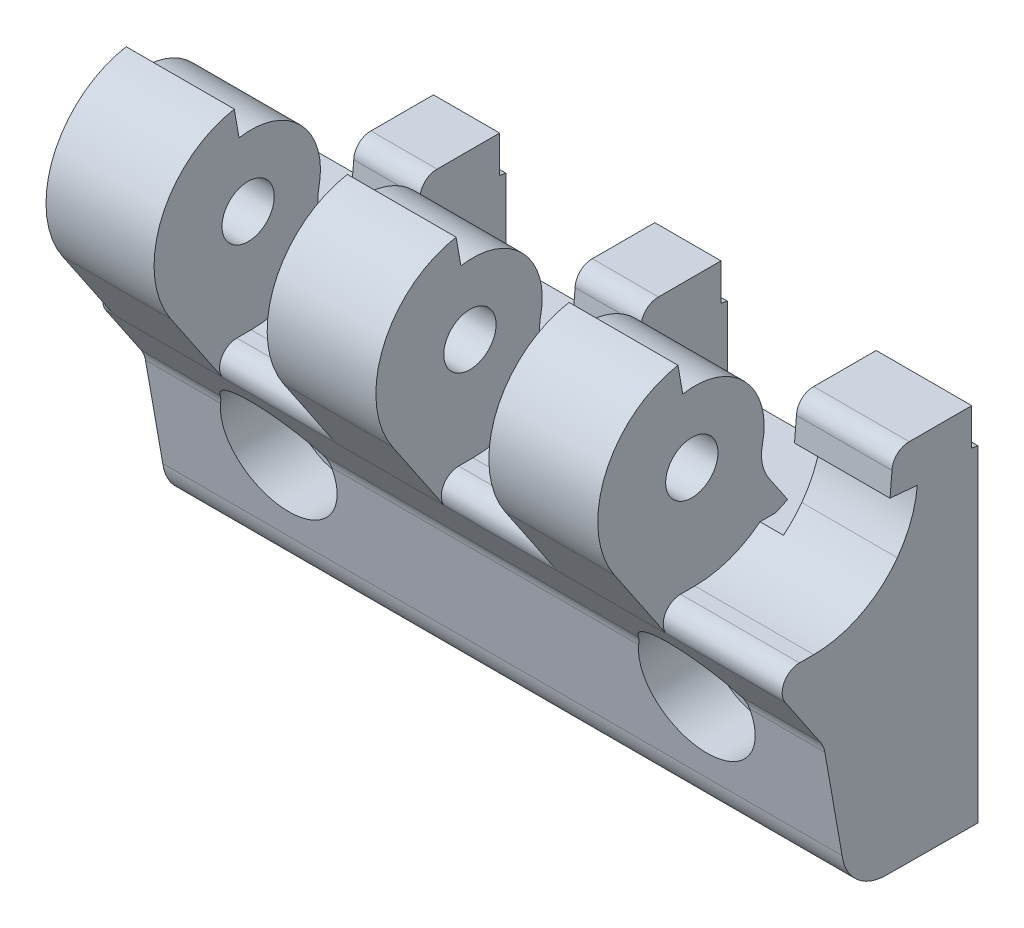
ISO-10303-21;
HEADER;
FILE_DESCRIPTION(('STEP AP214'),'2;1');
FILE_NAME('part.step','',(''),(''),'','','');
FILE_SCHEMA(('AUTOMOTIVE_DESIGN { 1 0 10303 214 1 1 1 1 }'));
ENDSEC;
DATA;
#1=APPLICATION_CONTEXT('core data for automotive mechanical design processes');
#2=APPLICATION_PROTOCOL_DEFINITION('international standard','automotive_design',2000,#1);
#3=PRODUCT_CONTEXT('',#1,'mechanical');
#4=PRODUCT('Part','Part','',(#3));
#5=PRODUCT_RELATED_PRODUCT_CATEGORY('part','',(#4));
#6=PRODUCT_DEFINITION_FORMATION('','',#4);
#7=PRODUCT_DEFINITION_CONTEXT('part definition',#1,'design');
#8=PRODUCT_DEFINITION('design','',#6,#7);
#9=PRODUCT_DEFINITION_SHAPE('','',#8);
#10=(LENGTH_UNIT() NAMED_UNIT(*) SI_UNIT(.MILLI.,.METRE.));
#11=(NAMED_UNIT(*) PLANE_ANGLE_UNIT() SI_UNIT($,.RADIAN.));
#12=(NAMED_UNIT(*) SI_UNIT($,.STERADIAN.) SOLID_ANGLE_UNIT());
#13=UNCERTAINTY_MEASURE_WITH_UNIT(LENGTH_MEASURE(1.E-05),#10,'distance_accuracy_value','');
#14=(GEOMETRIC_REPRESENTATION_CONTEXT(3) GLOBAL_UNCERTAINTY_ASSIGNED_CONTEXT((#13)) GLOBAL_UNIT_ASSIGNED_CONTEXT((#10,
#11,#12)) REPRESENTATION_CONTEXT('',''));
#15=CARTESIAN_POINT('',(0.,0.,0.));
#16=DIRECTION('',(0.,0.,1.));
#17=DIRECTION('',(1.,0.,0.));
#18=AXIS2_PLACEMENT_3D('',#15,#16,#17);
#19=CARTESIAN_POINT('',(-11.67,17.6979546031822,5.35403256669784));
#20=DIRECTION('',(-1.,0.,0.));
#21=DIRECTION('',(0.,-1.,0.));
#22=AXIS2_PLACEMENT_3D('',#19,#20,#21);
#23=CYLINDRICAL_SURFACE('',#22,3.97949973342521);
#24=DIRECTION('',(1.,0.,0.));
#25=VECTOR('',#24,1.);
#26=CARTESIAN_POINT('',(-11.67,15.4699793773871,8.65138673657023));
#27=LINE('',#26,#25);
#28=CARTESIAN_POINT('',(-11.67,15.4699794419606,8.65138678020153));
#29=VERTEX_POINT('',#28);
#30=CARTESIAN_POINT('',(-1.33,15.4699794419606,8.65138678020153));
#31=VERTEX_POINT('',#30);
#32=EDGE_CURVE('E485',#29,#31,#27,.T.);
#33=ORIENTED_EDGE('',*,*,#32,.F.);
#34=CARTESIAN_POINT('',(-11.67,17.6979546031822,5.35403256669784));
#35=DIRECTION('',(-1.,0.,0.));
#36=DIRECTION('',(0.,-1.,0.));
#37=AXIS2_PLACEMENT_3D('',#34,#35,#36);
#38=CIRCLE('',#37,3.97949973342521);
#39=CARTESIAN_POINT('',(-11.67,18.5614666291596,9.23871596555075));
#40=VERTEX_POINT('',#39);
#41=EDGE_CURVE('E471',#29,#40,#38,.T.);
#42=ORIENTED_EDGE('',*,*,#41,.T.);
#43=DIRECTION('',(-1.,0.,0.));
#44=VECTOR('',#43,1.);
#45=CARTESIAN_POINT('',(-11.67,18.5614666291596,9.23871596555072));
#46=LINE('',#45,#44);
#47=CARTESIAN_POINT('',(-1.33,18.5614666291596,9.23871596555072));
#48=VERTEX_POINT('',#47);
#49=EDGE_CURVE('E1098',#48,#40,#46,.T.);
#50=ORIENTED_EDGE('',*,*,#49,.F.);
#51=CARTESIAN_POINT('',(-1.33,17.6979546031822,5.35403256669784));
#52=DIRECTION('',(-1.,0.,0.));
#53=DIRECTION('',(0.,-1.,0.));
#54=AXIS2_PLACEMENT_3D('',#51,#52,#53);
#55=CIRCLE('',#54,3.97949973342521);
#56=EDGE_CURVE('E487',#31,#48,#55,.T.);
#57=ORIENTED_EDGE('',*,*,#56,.F.);
#58=EDGE_LOOP('',(#33,#42,#50,#57));
#59=FACE_BOUND('',#58,.T.);
#60=ADVANCED_FACE('F15',(#59),#23,.F.);
#61=CARTESIAN_POINT('',(-11.67,20.0002680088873,15.7132743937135));
#62=DIRECTION('',(-1.,0.,0.));
#63=DIRECTION('',(0.,-1.,0.));
#64=AXIS2_PLACEMENT_3D('',#61,#62,#63);
#65=CYLINDRICAL_SURFACE('',#64,6.6325);
#66=CARTESIAN_POINT('',(-11.67,20.0002680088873,15.7132743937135));
#67=DIRECTION('',(-1.,0.,0.));
#68=DIRECTION('',(0.,-1.,0.));
#69=AXIS2_PLACEMENT_3D('',#66,#67,#68);
#70=CIRCLE('',#69,6.6325);
#71=CARTESIAN_POINT('',(-11.67,26.5319666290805,16.8652159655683));
#72=VERTEX_POINT('',#71);
#73=EDGE_CURVE('E480',#40,#72,#70,.F.);
#74=ORIENTED_EDGE('',*,*,#73,.T.);
#75=DIRECTION('',(1.,0.,0.));
#76=VECTOR('',#75,1.);
#77=CARTESIAN_POINT('',(-11.67,26.5319666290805,16.8652159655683));
#78=LINE('',#77,#76);
#79=CARTESIAN_POINT('',(-1.33,26.5319666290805,16.8652159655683));
#80=VERTEX_POINT('',#79);
#81=EDGE_CURVE('E1095',#80,#72,#78,.F.);
#82=ORIENTED_EDGE('',*,*,#81,.F.);
#83=CARTESIAN_POINT('',(-1.33,20.0002680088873,15.7132743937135));
#84=DIRECTION('',(-1.,0.,0.));
#85=DIRECTION('',(0.,-1.,0.));
#86=AXIS2_PLACEMENT_3D('',#83,#84,#85);
#87=CIRCLE('',#86,6.6325);
#88=EDGE_CURVE('E726',#48,#80,#87,.F.);
#89=ORIENTED_EDGE('',*,*,#88,.F.);
#90=ORIENTED_EDGE('',*,*,#49,.T.);
#91=EDGE_LOOP('',(#74,#82,#89,#90));
#92=FACE_BOUND('',#91,.T.);
#93=ADVANCED_FACE('F1741',(#92),#65,.T.);
#94=CARTESIAN_POINT('',(-11.67,29.1444666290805,17.3262159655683));
#95=DIRECTION('',(0.,0.17377458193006,-0.98478545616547));
#96=DIRECTION('',(0.,0.98478545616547,0.17377458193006));
#97=AXIS2_PLACEMENT_3D('',#94,#95,#96);
#98=PLANE('',#97);
#99=DIRECTION('',(0.,0.98478545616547,0.173774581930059));
#100=VECTOR('',#99,1.);
#101=CARTESIAN_POINT('',(-11.67,26.5319666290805,16.8652159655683));
#102=LINE('',#101,#100);
#103=CARTESIAN_POINT('',(-11.67,29.1444666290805,17.3262159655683));
#104=VERTEX_POINT('',#103);
#105=EDGE_CURVE('E1465',#72,#104,#102,.T.);
#106=ORIENTED_EDGE('',*,*,#105,.T.);
#107=DIRECTION('',(-1.,0.,0.));
#108=VECTOR('',#107,1.);
#109=CARTESIAN_POINT('',(-11.67,29.1444666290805,17.3262159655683));
#110=LINE('',#109,#108);
#111=CARTESIAN_POINT('',(-1.33,29.1444666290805,17.3262159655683));
#112=VERTEX_POINT('',#111);
#113=EDGE_CURVE('E1091',#112,#104,#110,.T.);
#114=ORIENTED_EDGE('',*,*,#113,.F.);
#115=DIRECTION('',(0.,0.98478545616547,0.173774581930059));
#116=VECTOR('',#115,1.);
#117=CARTESIAN_POINT('',(-1.33,26.5319666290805,16.8652159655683));
#118=LINE('',#117,#116);
#119=EDGE_CURVE('E725',#80,#112,#118,.T.);
#120=ORIENTED_EDGE('',*,*,#119,.F.);
#121=ORIENTED_EDGE('',*,*,#81,.T.);
#122=EDGE_LOOP('',(#106,#114,#120,#121));
#123=FACE_BOUND('',#122,.T.);
#124=ADVANCED_FACE('F1743',(#123),#98,.T.);
#125=CARTESIAN_POINT('',(-11.67,20.0000000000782,15.7140000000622));
#126=DIRECTION('',(-1.,0.,0.));
#127=DIRECTION('',(0.,-1.,0.));
#128=AXIS2_PLACEMENT_3D('',#125,#126,#127);
#129=CYLINDRICAL_SURFACE('',#128,9.28549999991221);
#130=CARTESIAN_POINT('',(-11.67,20.0000000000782,15.7140000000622));
#131=DIRECTION('',(-1.,0.,0.));
#132=DIRECTION('',(0.,-1.,0.));
#133=AXIS2_PLACEMENT_3D('',#130,#131,#132);
#134=CIRCLE('',#133,9.28549999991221);
#135=CARTESIAN_POINT('',(-11.67,14.8019985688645,23.4082375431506));
#136=VERTEX_POINT('',#135);
#137=EDGE_CURVE('E1464',#104,#136,#134,.F.);
#138=ORIENTED_EDGE('',*,*,#137,.T.);
#139=DIRECTION('',(1.,0.,0.));
#140=VECTOR('',#139,1.);
#141=CARTESIAN_POINT('',(-11.67,14.8019985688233,23.4082375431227));
#142=LINE('',#141,#140);
#143=CARTESIAN_POINT('',(-1.33,14.8019985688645,23.4082375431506));
#144=VERTEX_POINT('',#143);
#145=EDGE_CURVE('E1087',#144,#136,#142,.F.);
#146=ORIENTED_EDGE('',*,*,#145,.F.);
#147=CARTESIAN_POINT('',(-1.33,20.0000000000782,15.7140000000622));
#148=DIRECTION('',(-1.,0.,0.));
#149=DIRECTION('',(0.,-1.,0.));
#150=AXIS2_PLACEMENT_3D('',#147,#148,#149);
#151=CIRCLE('',#150,9.28549999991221);
#152=EDGE_CURVE('E721',#112,#144,#151,.F.);
#153=ORIENTED_EDGE('',*,*,#152,.F.);
#154=ORIENTED_EDGE('',*,*,#113,.T.);
#155=EDGE_LOOP('',(#138,#146,#153,#154));
#156=FACE_BOUND('',#155,.T.);
#157=ADVANCED_FACE('F1746',(#156),#129,.T.);
#158=CARTESIAN_POINT('',(19.89,17.6979546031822,5.35403256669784));
#159=DIRECTION('',(1.,0.,0.));
#160=DIRECTION('',(0.,1.,0.));
#161=AXIS2_PLACEMENT_3D('',#158,#159,#160);
#162=CYLINDRICAL_SURFACE('',#161,3.97949973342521);
#163=DIRECTION('',(1.,0.,0.));
#164=VECTOR('',#163,1.);
#165=CARTESIAN_POINT('',(19.89,18.5614666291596,9.23871596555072));
#166=LINE('',#165,#164);
#167=CARTESIAN_POINT('',(19.89,18.5614666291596,9.23871596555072));
#168=VERTEX_POINT('',#167);
#169=CARTESIAN_POINT('',(9.49,18.5614666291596,9.23871596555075));
#170=VERTEX_POINT('',#169);
#171=EDGE_CURVE('E1094',#168,#170,#166,.F.);
#172=ORIENTED_EDGE('',*,*,#171,.F.);
#173=CARTESIAN_POINT('',(19.89,17.6979546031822,5.35403256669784));
#174=DIRECTION('',(1.,0.,0.));
#175=DIRECTION('',(0.,1.,0.));
#176=AXIS2_PLACEMENT_3D('',#173,#174,#175);
#177=CIRCLE('',#176,3.97949973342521);
#178=CARTESIAN_POINT('',(19.89,15.4699794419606,8.65138678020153));
#179=VERTEX_POINT('',#178);
#180=EDGE_CURVE('E708',#179,#168,#177,.F.);
#181=ORIENTED_EDGE('',*,*,#180,.F.);
#182=DIRECTION('',(1.,0.,0.));
#183=VECTOR('',#182,1.);
#184=CARTESIAN_POINT('',(19.89,15.4699793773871,8.65138673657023));
#185=LINE('',#184,#183);
#186=CARTESIAN_POINT('',(9.49,15.4699794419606,8.65138678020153));
#187=VERTEX_POINT('',#186);
#188=EDGE_CURVE('E490',#187,#179,#185,.T.);
#189=ORIENTED_EDGE('',*,*,#188,.F.);
#190=CARTESIAN_POINT('',(9.49,17.6979546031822,5.35403256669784));
#191=DIRECTION('',(1.,0.,0.));
#192=DIRECTION('',(0.,1.,0.));
#193=AXIS2_PLACEMENT_3D('',#190,#191,#192);
#194=CIRCLE('',#193,3.97949973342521);
#195=EDGE_CURVE('E737',#187,#170,#194,.F.);
#196=ORIENTED_EDGE('',*,*,#195,.T.);
#197=EDGE_LOOP('',(#172,#181,#189,#196));
#198=FACE_BOUND('',#197,.T.);
#199=ADVANCED_FACE('F1523',(#198),#162,.F.);
#200=CARTESIAN_POINT('',(19.89,20.0002680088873,15.7132743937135));
#201=DIRECTION('',(1.,0.,0.));
#202=DIRECTION('',(0.,1.,0.));
#203=AXIS2_PLACEMENT_3D('',#200,#201,#202);
#204=CYLINDRICAL_SURFACE('',#203,6.6325);
#205=CARTESIAN_POINT('',(19.89,20.0002680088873,15.7132743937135));
#206=DIRECTION('',(1.,0.,0.));
#207=DIRECTION('',(0.,1.,0.));
#208=AXIS2_PLACEMENT_3D('',#205,#206,#207);
#209=CIRCLE('',#208,6.6325);
#210=CARTESIAN_POINT('',(19.89,26.5319666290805,16.8652159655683));
#211=VERTEX_POINT('',#210);
#212=EDGE_CURVE('E705',#168,#211,#209,.T.);
#213=ORIENTED_EDGE('',*,*,#212,.F.);
#214=ORIENTED_EDGE('',*,*,#171,.T.);
#215=CARTESIAN_POINT('',(9.49,20.0002680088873,15.7132743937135));
#216=DIRECTION('',(1.,0.,0.));
#217=DIRECTION('',(0.,1.,0.));
#218=AXIS2_PLACEMENT_3D('',#215,#216,#217);
#219=CIRCLE('',#218,6.6325);
#220=CARTESIAN_POINT('',(9.49,26.5319666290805,16.8652159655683));
#221=VERTEX_POINT('',#220);
#222=EDGE_CURVE('E735',#170,#221,#219,.T.);
#223=ORIENTED_EDGE('',*,*,#222,.T.);
#224=DIRECTION('',(1.,0.,0.));
#225=VECTOR('',#224,1.);
#226=CARTESIAN_POINT('',(19.89,26.5319666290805,16.8652159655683));
#227=LINE('',#226,#225);
#228=EDGE_CURVE('E1501',#211,#221,#227,.F.);
#229=ORIENTED_EDGE('',*,*,#228,.F.);
#230=EDGE_LOOP('',(#213,#214,#223,#229));
#231=FACE_BOUND('',#230,.T.);
#232=ADVANCED_FACE('F1509',(#231),#204,.T.);
#233=CARTESIAN_POINT('',(19.89,26.5319666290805,16.8652159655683));
#234=DIRECTION('',(0.,0.17377458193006,-0.98478545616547));
#235=DIRECTION('',(0.,0.98478545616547,0.17377458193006));
#236=AXIS2_PLACEMENT_3D('',#233,#234,#235);
#237=PLANE('',#236);
#238=DIRECTION('',(0.,0.98478545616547,0.173774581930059));
#239=VECTOR('',#238,1.);
#240=CARTESIAN_POINT('',(19.89,26.5319666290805,16.8652159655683));
#241=LINE('',#240,#239);
#242=CARTESIAN_POINT('',(19.89,29.1444666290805,17.3262159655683));
#243=VERTEX_POINT('',#242);
#244=EDGE_CURVE('E704',#211,#243,#241,.T.);
#245=ORIENTED_EDGE('',*,*,#244,.F.);
#246=ORIENTED_EDGE('',*,*,#228,.T.);
#247=DIRECTION('',(0.,0.98478545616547,0.173774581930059));
#248=VECTOR('',#247,1.);
#249=CARTESIAN_POINT('',(9.49,26.5319666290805,16.8652159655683));
#250=LINE('',#249,#248);
#251=CARTESIAN_POINT('',(9.49,29.1444666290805,17.3262159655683));
#252=VERTEX_POINT('',#251);
#253=EDGE_CURVE('E734',#221,#252,#250,.T.);
#254=ORIENTED_EDGE('',*,*,#253,.T.);
#255=DIRECTION('',(1.,0.,0.));
#256=VECTOR('',#255,1.);
#257=CARTESIAN_POINT('',(19.89,29.1444666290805,17.3262159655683));
#258=LINE('',#257,#256);
#259=EDGE_CURVE('E1483',#243,#252,#258,.F.);
#260=ORIENTED_EDGE('',*,*,#259,.F.);
#261=EDGE_LOOP('',(#245,#246,#254,#260));
#262=FACE_BOUND('',#261,.T.);
#263=ADVANCED_FACE('F1518',(#262),#237,.T.);
#264=CARTESIAN_POINT('',(19.89,20.0000000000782,15.7140000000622));
#265=DIRECTION('',(1.,0.,0.));
#266=DIRECTION('',(0.,1.,0.));
#267=AXIS2_PLACEMENT_3D('',#264,#265,#266);
#268=CYLINDRICAL_SURFACE('',#267,9.28549999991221);
#269=CARTESIAN_POINT('',(19.89,20.0000000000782,15.7140000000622));
#270=DIRECTION('',(1.,0.,0.));
#271=DIRECTION('',(0.,1.,0.));
#272=AXIS2_PLACEMENT_3D('',#269,#270,#271);
#273=CIRCLE('',#272,9.28549999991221);
#274=CARTESIAN_POINT('',(19.89,14.8019985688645,23.4082375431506));
#275=VERTEX_POINT('',#274);
#276=EDGE_CURVE('E700',#243,#275,#273,.T.);
#277=ORIENTED_EDGE('',*,*,#276,.F.);
#278=ORIENTED_EDGE('',*,*,#259,.T.);
#279=CARTESIAN_POINT('',(9.49,20.0000000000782,15.7140000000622));
#280=DIRECTION('',(1.,0.,0.));
#281=DIRECTION('',(0.,1.,0.));
#282=AXIS2_PLACEMENT_3D('',#279,#280,#281);
#283=CIRCLE('',#282,9.28549999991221);
#284=CARTESIAN_POINT('',(9.49,14.8019985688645,23.4082375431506));
#285=VERTEX_POINT('',#284);
#286=EDGE_CURVE('E731',#252,#285,#283,.T.);
#287=ORIENTED_EDGE('',*,*,#286,.T.);
#288=DIRECTION('',(1.,0.,0.));
#289=VECTOR('',#288,1.);
#290=CARTESIAN_POINT('',(19.89,14.8019985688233,23.4082375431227));
#291=LINE('',#290,#289);
#292=EDGE_CURVE('E1474',#275,#285,#291,.F.);
#293=ORIENTED_EDGE('',*,*,#292,.F.);
#294=EDGE_LOOP('',(#277,#278,#287,#293));
#295=FACE_BOUND('',#294,.T.);
#296=ADVANCED_FACE('F1521',(#295),#268,.T.);
#297=CARTESIAN_POINT('',(41.12,17.6979546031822,5.35403256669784));
#298=DIRECTION('',(1.,0.,0.));
#299=DIRECTION('',(0.,1.,0.));
#300=AXIS2_PLACEMENT_3D('',#297,#298,#299);
#301=CYLINDRICAL_SURFACE('',#300,3.97949973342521);
#302=DIRECTION('',(1.,0.,0.));
#303=VECTOR('',#302,1.);
#304=CARTESIAN_POINT('',(41.12,18.5614666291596,9.23871596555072));
#305=LINE('',#304,#303);
#306=CARTESIAN_POINT('',(41.12,18.5614666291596,9.23871596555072));
#307=VERTEX_POINT('',#306);
#308=CARTESIAN_POINT('',(30.7,18.5614666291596,9.23871596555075));
#309=VERTEX_POINT('',#308);
#310=EDGE_CURVE('E1480',#307,#309,#305,.F.);
#311=ORIENTED_EDGE('',*,*,#310,.F.);
#312=CARTESIAN_POINT('',(41.12,17.6979546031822,5.35403256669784));
#313=DIRECTION('',(1.,0.,0.));
#314=DIRECTION('',(0.,1.,0.));
#315=AXIS2_PLACEMENT_3D('',#312,#313,#314);
#316=CIRCLE('',#315,3.97949973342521);
#317=CARTESIAN_POINT('',(41.12,15.4699794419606,8.65138678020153));
#318=VERTEX_POINT('',#317);
#319=EDGE_CURVE('E696',#318,#307,#316,.F.);
#320=ORIENTED_EDGE('',*,*,#319,.F.);
#321=DIRECTION('',(1.,0.,0.));
#322=VECTOR('',#321,1.);
#323=CARTESIAN_POINT('',(41.12,15.4699793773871,8.65138673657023));
#324=LINE('',#323,#322);
#325=CARTESIAN_POINT('',(30.7,15.4699794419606,8.65138678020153));
#326=VERTEX_POINT('',#325);
#327=EDGE_CURVE('E1422',#326,#318,#324,.T.);
#328=ORIENTED_EDGE('',*,*,#327,.F.);
#329=CARTESIAN_POINT('',(30.7,17.6979546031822,5.35403256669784));
#330=DIRECTION('',(1.,0.,0.));
#331=DIRECTION('',(0.,1.,0.));
#332=AXIS2_PLACEMENT_3D('',#329,#330,#331);
#333=CIRCLE('',#332,3.97949973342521);
#334=EDGE_CURVE('E718',#326,#309,#333,.F.);
#335=ORIENTED_EDGE('',*,*,#334,.T.);
#336=EDGE_LOOP('',(#311,#320,#328,#335));
#337=FACE_BOUND('',#336,.T.);
#338=ADVANCED_FACE('F1645',(#337),#301,.F.);
#339=CARTESIAN_POINT('',(41.12,20.0002680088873,15.7132743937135));
#340=DIRECTION('',(1.,0.,0.));
#341=DIRECTION('',(0.,1.,0.));
#342=AXIS2_PLACEMENT_3D('',#339,#340,#341);
#343=CYLINDRICAL_SURFACE('',#342,6.6325);
#344=CARTESIAN_POINT('',(41.12,20.0002680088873,15.7132743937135));
#345=DIRECTION('',(1.,0.,0.));
#346=DIRECTION('',(0.,1.,0.));
#347=AXIS2_PLACEMENT_3D('',#344,#345,#346);
#348=CIRCLE('',#347,6.6325);
#349=CARTESIAN_POINT('',(41.12,26.5319666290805,16.8652159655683));
#350=VERTEX_POINT('',#349);
#351=EDGE_CURVE('E693',#307,#350,#348,.T.);
#352=ORIENTED_EDGE('',*,*,#351,.F.);
#353=ORIENTED_EDGE('',*,*,#310,.T.);
#354=CARTESIAN_POINT('',(30.7,20.0002680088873,15.7132743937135));
#355=DIRECTION('',(1.,0.,0.));
#356=DIRECTION('',(0.,1.,0.));
#357=AXIS2_PLACEMENT_3D('',#354,#355,#356);
#358=CIRCLE('',#357,6.6325);
#359=CARTESIAN_POINT('',(30.7,26.5319666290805,16.8652159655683));
#360=VERTEX_POINT('',#359);
#361=EDGE_CURVE('E716',#309,#360,#358,.T.);
#362=ORIENTED_EDGE('',*,*,#361,.T.);
#363=DIRECTION('',(1.,0.,0.));
#364=VECTOR('',#363,1.);
#365=CARTESIAN_POINT('',(41.12,26.5319666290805,16.8652159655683));
#366=LINE('',#365,#364);
#367=EDGE_CURVE('E1477',#350,#360,#366,.F.);
#368=ORIENTED_EDGE('',*,*,#367,.F.);
#369=EDGE_LOOP('',(#352,#353,#362,#368));
#370=FACE_BOUND('',#369,.T.);
#371=ADVANCED_FACE('F1648',(#370),#343,.T.);
#372=CARTESIAN_POINT('',(41.12,26.5319666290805,16.8652159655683));
#373=DIRECTION('',(0.,0.17377458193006,-0.98478545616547));
#374=DIRECTION('',(0.,0.98478545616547,0.17377458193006));
#375=AXIS2_PLACEMENT_3D('',#372,#373,#374);
#376=PLANE('',#375);
#377=DIRECTION('',(0.,0.98478545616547,0.173774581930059));
#378=VECTOR('',#377,1.);
#379=CARTESIAN_POINT('',(41.12,26.5319666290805,16.8652159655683));
#380=LINE('',#379,#378);
#381=CARTESIAN_POINT('',(41.12,29.1444666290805,17.3262159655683));
#382=VERTEX_POINT('',#381);
#383=EDGE_CURVE('E692',#350,#382,#380,.T.);
#384=ORIENTED_EDGE('',*,*,#383,.F.);
#385=ORIENTED_EDGE('',*,*,#367,.T.);
#386=DIRECTION('',(0.,0.98478545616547,0.173774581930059));
#387=VECTOR('',#386,1.);
#388=CARTESIAN_POINT('',(30.7,26.5319666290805,16.8652159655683));
#389=LINE('',#388,#387);
#390=CARTESIAN_POINT('',(30.7,29.1444666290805,17.3262159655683));
#391=VERTEX_POINT('',#390);
#392=EDGE_CURVE('E715',#360,#391,#389,.T.);
#393=ORIENTED_EDGE('',*,*,#392,.T.);
#394=DIRECTION('',(1.,0.,0.));
#395=VECTOR('',#394,1.);
#396=CARTESIAN_POINT('',(41.12,29.1444666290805,17.3262159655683));
#397=LINE('',#396,#395);
#398=EDGE_CURVE('E1090',#382,#391,#397,.F.);
#399=ORIENTED_EDGE('',*,*,#398,.F.);
#400=EDGE_LOOP('',(#384,#385,#393,#399));
#401=FACE_BOUND('',#400,.T.);
#402=ADVANCED_FACE('F1651',(#401),#376,.T.);
#403=CARTESIAN_POINT('',(41.12,20.0000000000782,15.7140000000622));
#404=DIRECTION('',(1.,0.,0.));
#405=DIRECTION('',(0.,1.,0.));
#406=AXIS2_PLACEMENT_3D('',#403,#404,#405);
#407=CYLINDRICAL_SURFACE('',#406,9.28549999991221);
#408=CARTESIAN_POINT('',(41.12,20.0000000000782,15.7140000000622));
#409=DIRECTION('',(1.,0.,0.));
#410=DIRECTION('',(0.,1.,0.));
#411=AXIS2_PLACEMENT_3D('',#408,#409,#410);
#412=CIRCLE('',#411,9.28549999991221);
#413=CARTESIAN_POINT('',(41.12,14.8019985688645,23.4082375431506));
#414=VERTEX_POINT('',#413);
#415=EDGE_CURVE('E689',#382,#414,#412,.T.);
#416=ORIENTED_EDGE('',*,*,#415,.F.);
#417=ORIENTED_EDGE('',*,*,#398,.T.);
#418=CARTESIAN_POINT('',(30.7,20.0000000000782,15.7140000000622));
#419=DIRECTION('',(1.,0.,0.));
#420=DIRECTION('',(0.,1.,0.));
#421=AXIS2_PLACEMENT_3D('',#418,#419,#420);
#422=CIRCLE('',#421,9.28549999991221);
#423=CARTESIAN_POINT('',(30.7,14.8019985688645,23.4082375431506));
#424=VERTEX_POINT('',#423);
#425=EDGE_CURVE('E712',#391,#424,#422,.T.);
#426=ORIENTED_EDGE('',*,*,#425,.T.);
#427=DIRECTION('',(1.,0.,0.));
#428=VECTOR('',#427,1.);
#429=CARTESIAN_POINT('',(41.12,14.8019985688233,23.4082375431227));
#430=LINE('',#429,#428);
#431=EDGE_CURVE('E1463',#414,#424,#430,.F.);
#432=ORIENTED_EDGE('',*,*,#431,.F.);
#433=EDGE_LOOP('',(#416,#417,#426,#432));
#434=FACE_BOUND('',#433,.T.);
#435=ADVANCED_FACE('F1622',(#434),#407,.T.);
#436=CARTESIAN_POINT('',(-11.67,7.4644666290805,18.4512159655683));
#437=DIRECTION('',(0.,-0.559797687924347,0.828629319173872));
#438=DIRECTION('',(0.,-0.828629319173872,-0.559797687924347));
#439=AXIS2_PLACEMENT_3D('',#436,#437,#438);
#440=PLANE('',#439);
#441=ORIENTED_EDGE('',*,*,#145,.T.);
#442=DIRECTION('',(0.,-0.82862931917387,-0.559797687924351));
#443=VECTOR('',#442,1.);
#444=CARTESIAN_POINT('',(-11.67,14.8019985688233,23.4082375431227));
#445=LINE('',#444,#443);
#446=CARTESIAN_POINT('',(-11.67,7.48718669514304,18.4665649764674));
#447=VERTEX_POINT('',#446);
#448=EDGE_CURVE('E1461',#136,#447,#445,.T.);
#449=ORIENTED_EDGE('',*,*,#448,.T.);
#450=DIRECTION('',(1.,0.,0.));
#451=VECTOR('',#450,1.);
#452=CARTESIAN_POINT('',(52.5,7.4871866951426,18.4665649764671));
#453=LINE('',#452,#451);
#454=CARTESIAN_POINT('',(-1.33,7.48718669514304,18.4665649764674));
#455=VERTEX_POINT('',#454);
#456=EDGE_CURVE('E672',#455,#447,#453,.F.);
#457=ORIENTED_EDGE('',*,*,#456,.F.);
#458=DIRECTION('',(0.,-0.82862931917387,-0.559797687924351));
#459=VECTOR('',#458,1.);
#460=CARTESIAN_POINT('',(-1.33,14.8019985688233,23.4082375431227));
#461=LINE('',#460,#459);
#462=EDGE_CURVE('E724',#144,#455,#461,.T.);
#463=ORIENTED_EDGE('',*,*,#462,.F.);
#464=EDGE_LOOP('',(#441,#449,#457,#463));
#465=FACE_BOUND('',#464,.T.);
#466=ADVANCED_FACE('F1667',(#465),#440,.T.);
#467=CARTESIAN_POINT('',(-11.67,20.,0.));
#468=DIRECTION('',(1.,0.,0.));
#469=DIRECTION('',(0.,1.,0.));
#470=AXIS2_PLACEMENT_3D('',#467,#468,#469);
#471=PLANE('',#470);
#472=CARTESIAN_POINT('',(-11.67,20.,16.));
#473=DIRECTION('',(-1.,0.,0.));
#474=DIRECTION('',(0.,0.,1.));
#475=AXIS2_PLACEMENT_3D('',#472,#473,#474);
#476=CIRCLE('',#475,2.5);
#477=CARTESIAN_POINT('',(-11.67,20.,18.5));
#478=VERTEX_POINT('',#477);
#479=EDGE_CURVE('E1608',#478,#478,#476,.T.);
#480=ORIENTED_EDGE('',*,*,#479,.F.);
#481=EDGE_LOOP('',(#480));
#482=FACE_BOUND('',#481,.T.);
#483=ORIENTED_EDGE('',*,*,#448,.F.);
#484=ORIENTED_EDGE('',*,*,#137,.F.);
#485=ORIENTED_EDGE('',*,*,#105,.F.);
#486=ORIENTED_EDGE('',*,*,#73,.F.);
#487=ORIENTED_EDGE('',*,*,#41,.F.);
#488=DIRECTION('',(0.,0.828585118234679,0.55986310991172));
#489=VECTOR('',#488,1.);
#490=CARTESIAN_POINT('',(-11.67,15.4699793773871,8.65138673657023));
#491=LINE('',#490,#489);
#492=CARTESIAN_POINT('',(-11.67,12.7724666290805,6.82871596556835));
#493=VERTEX_POINT('',#492);
#494=EDGE_CURVE('E477',#493,#29,#491,.T.);
#495=ORIENTED_EDGE('',*,*,#494,.F.);
#496=DIRECTION('',(0.,0.415426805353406,-0.909626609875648));
#497=VECTOR('',#496,1.);
#498=CARTESIAN_POINT('',(-11.67,12.25,7.97271905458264));
#499=LINE('',#498,#497);
#500=CARTESIAN_POINT('',(-11.67,12.25,7.97271905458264));
#501=VERTEX_POINT('',#500);
#502=EDGE_CURVE('E483',#501,#493,#499,.T.);
#503=ORIENTED_EDGE('',*,*,#502,.F.);
#504=DIRECTION('',(0.,0.,1.));
#505=VECTOR('',#504,1.);
#506=CARTESIAN_POINT('',(-11.67,12.25,0.));
#507=LINE('',#506,#505);
#508=CARTESIAN_POINT('',(-11.67,12.25,9.47537381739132));
#509=VERTEX_POINT('',#508);
#510=EDGE_CURVE('E506',#509,#501,#507,.F.);
#511=ORIENTED_EDGE('',*,*,#510,.F.);
#512=CARTESIAN_POINT('',(-11.67,19.9999999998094,15.7139714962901));
#513=DIRECTION('',(1.,0.,0.));
#514=DIRECTION('',(0.,1.,0.));
#515=AXIS2_PLACEMENT_3D('',#512,#513,#514);
#516=CIRCLE('',#515,9.94899999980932);
#517=CARTESIAN_POINT('',(-11.67,10.051,15.7139714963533));
#518=VERTEX_POINT('',#517);
#519=EDGE_CURVE('E677',#509,#518,#516,.F.);
#520=ORIENTED_EDGE('',*,*,#519,.T.);
#521=DIRECTION('',(0.,0.,1.));
#522=VECTOR('',#521,1.);
#523=CARTESIAN_POINT('',(-11.67,10.051,15.7139714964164));
#524=LINE('',#523,#522);
#525=CARTESIAN_POINT('',(-11.67,10.051,17.0778728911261));
#526=VERTEX_POINT('',#525);
#527=EDGE_CURVE('E679',#526,#518,#524,.F.);
#528=ORIENTED_EDGE('',*,*,#527,.F.);
#529=CARTESIAN_POINT('',(-11.67,8.3930001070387,17.0778728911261));
#530=DIRECTION('',(1.,0.,0.));
#531=DIRECTION('',(0.,1.,0.));
#532=AXIS2_PLACEMENT_3D('',#529,#530,#531);
#533=CIRCLE('',#532,1.65799989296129);
#534=EDGE_CURVE('E668',#447,#526,#533,.F.);
#535=ORIENTED_EDGE('',*,*,#534,.F.);
#536=EDGE_LOOP('',(#483,#484,#485,#486,#487,#495,#503,#511,#520,#528,#535));
#537=FACE_BOUND('',#536,.T.);
#538=ADVANCED_FACE('F474',(#482,#537),#471,.F.);
#539=CARTESIAN_POINT('',(41.12,14.8019985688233,23.4082375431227));
#540=DIRECTION('',(0.,-0.559797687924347,0.828629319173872));
#541=DIRECTION('',(0.,-0.828629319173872,-0.559797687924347));
#542=AXIS2_PLACEMENT_3D('',#539,#540,#541);
#543=PLANE('',#542);
#544=ORIENTED_EDGE('',*,*,#431,.T.);
#545=DIRECTION('',(0.,-0.82862931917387,-0.559797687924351));
#546=VECTOR('',#545,1.);
#547=CARTESIAN_POINT('',(30.7,14.8019985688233,23.4082375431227));
#548=LINE('',#547,#546);
#549=CARTESIAN_POINT('',(30.7,7.48718669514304,18.4665649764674));
#550=VERTEX_POINT('',#549);
#551=EDGE_CURVE('E714',#424,#550,#548,.T.);
#552=ORIENTED_EDGE('',*,*,#551,.T.);
#553=DIRECTION('',(1.,0.,0.));
#554=VECTOR('',#553,1.);
#555=CARTESIAN_POINT('',(52.5,7.4871866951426,18.4665649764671));
#556=LINE('',#555,#554);
#557=CARTESIAN_POINT('',(41.12,7.48718669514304,18.4665649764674));
#558=VERTEX_POINT('',#557);
#559=EDGE_CURVE('E663',#558,#550,#556,.F.);
#560=ORIENTED_EDGE('',*,*,#559,.F.);
#561=DIRECTION('',(0.,-0.82862931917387,-0.559797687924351));
#562=VECTOR('',#561,1.);
#563=CARTESIAN_POINT('',(41.12,14.8019985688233,23.4082375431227));
#564=LINE('',#563,#562);
#565=EDGE_CURVE('E688',#414,#558,#564,.T.);
#566=ORIENTED_EDGE('',*,*,#565,.F.);
#567=EDGE_LOOP('',(#544,#552,#560,#566));
#568=FACE_BOUND('',#567,.T.);
#569=ADVANCED_FACE('F1626',(#568),#543,.T.);
#570=CARTESIAN_POINT('',(19.89,14.8019985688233,23.4082375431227));
#571=DIRECTION('',(0.,-0.559797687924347,0.828629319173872));
#572=DIRECTION('',(0.,-0.828629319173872,-0.559797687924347));
#573=AXIS2_PLACEMENT_3D('',#570,#571,#572);
#574=PLANE('',#573);
#575=ORIENTED_EDGE('',*,*,#292,.T.);
#576=DIRECTION('',(0.,-0.82862931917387,-0.559797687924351));
#577=VECTOR('',#576,1.);
#578=CARTESIAN_POINT('',(9.49,14.8019985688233,23.4082375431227));
#579=LINE('',#578,#577);
#580=CARTESIAN_POINT('',(9.49,7.48718669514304,18.4665649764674));
#581=VERTEX_POINT('',#580);
#582=EDGE_CURVE('E733',#285,#581,#579,.T.);
#583=ORIENTED_EDGE('',*,*,#582,.T.);
#584=DIRECTION('',(1.,0.,0.));
#585=VECTOR('',#584,1.);
#586=CARTESIAN_POINT('',(52.5,7.4871866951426,18.4665649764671));
#587=LINE('',#586,#585);
#588=CARTESIAN_POINT('',(19.89,7.48718669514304,18.4665649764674));
#589=VERTEX_POINT('',#588);
#590=EDGE_CURVE('E655',#589,#581,#587,.F.);
#591=ORIENTED_EDGE('',*,*,#590,.F.);
#592=DIRECTION('',(0.,-0.82862931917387,-0.559797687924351));
#593=VECTOR('',#592,1.);
#594=CARTESIAN_POINT('',(19.89,14.8019985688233,23.4082375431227));
#595=LINE('',#594,#593);
#596=EDGE_CURVE('E703',#275,#589,#595,.T.);
#597=ORIENTED_EDGE('',*,*,#596,.F.);
#598=EDGE_LOOP('',(#575,#583,#591,#597));
#599=FACE_BOUND('',#598,.T.);
#600=ADVANCED_FACE('F799',(#599),#574,.T.);
#601=CARTESIAN_POINT('',(0.,0.,13.));
#602=DIRECTION('',(0.,0.,1.));
#603=DIRECTION('',(1.,0.,0.));
#604=AXIS2_PLACEMENT_3D('',#601,#602,#603);
#605=CYLINDRICAL_SURFACE('',#604,5.5);
#606=CARTESIAN_POINT('',(0.,0.,8.));
#607=DIRECTION('',(0.,0.,1.));
#608=DIRECTION('',(1.,0.,0.));
#609=AXIS2_PLACEMENT_3D('',#606,#607,#608);
#610=CIRCLE('',#609,5.5);
#611=CARTESIAN_POINT('',(5.5,0.,8.));
#612=VERTEX_POINT('',#611);
#613=EDGE_CURVE('E685',#612,#612,#610,.F.);
#614=ORIENTED_EDGE('',*,*,#613,.T.);
#615=EDGE_LOOP('',(#614));
#616=FACE_BOUND('',#615,.T.);
#617=CARTESIAN_POINT('',(-4.92112506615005,2.4561205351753,15.0682436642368));
#618=CARTESIAN_POINT('',(-4.95168063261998,2.39491686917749,15.0268992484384));
#619=CARTESIAN_POINT('',(-4.98174667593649,2.33180101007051,14.9879859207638));
#620=CARTESIAN_POINT('',(-5.04048875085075,2.20193883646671,14.9152929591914));
#621=CARTESIAN_POINT('',(-5.06916287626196,2.13518779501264,14.8815202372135));
#622=CARTESIAN_POINT('',(-5.12412661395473,1.99964604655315,14.8200507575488));
#623=CARTESIAN_POINT('',(-5.1504498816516,1.93091376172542,14.792255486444));
#624=CARTESIAN_POINT('',(-5.20086331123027,1.79068739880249,14.7423394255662));
#625=CARTESIAN_POINT('',(-5.22495552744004,1.71919594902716,14.7202133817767));
#626=CARTESIAN_POINT('',(-5.25879980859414,1.61133113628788,14.6918135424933));
#627=CARTESIAN_POINT('',(-5.26954101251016,1.5758560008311,14.6832483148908));
#628=CARTESIAN_POINT('',(-5.29042919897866,1.50424613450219,14.6675218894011));
#629=CARTESIAN_POINT('',(-5.30057335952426,1.46810918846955,14.6603670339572));
#630=CARTESIAN_POINT('',(-5.3103776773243,1.4317433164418,14.6539547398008));
#631=B_SPLINE_CURVE_WITH_KNOTS('',3,(#617,#618,#619,#620,#621,#622,#623,#624,#625,#626,#627,
#628,#629,#630),.UNSPECIFIED.,.F.,.F.,(4,2,2,2,2,2,4),(0.,0.23976130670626,0.479842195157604,
0.715597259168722,0.951133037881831,1.06522909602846,1.17982709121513),.UNSPECIFIED.);
#632=CARTESIAN_POINT('',(-4.92112506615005,2.4561205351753,15.0682436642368));
#633=VERTEX_POINT('',#632);
#634=CARTESIAN_POINT('',(-5.3103776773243,1.4317433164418,14.6539547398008));
#635=VERTEX_POINT('',#634);
#636=EDGE_CURVE('E779',#633,#635,#631,.T.);
#637=ORIENTED_EDGE('',*,*,#636,.T.);
#638=CARTESIAN_POINT('',(0.,0.,14.4014999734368));
#639=DIRECTION('',(0.,-0.173648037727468,0.984807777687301));
#640=DIRECTION('',(0.,0.984807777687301,0.173648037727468));
#641=AXIS2_PLACEMENT_3D('',#638,#639,#640);
#642=ELLIPSE('',#641,5.58484622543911,5.5);
#643=CARTESIAN_POINT('',(5.3103776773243,1.4317433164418,14.6539547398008));
#644=VERTEX_POINT('',#643);
#645=EDGE_CURVE('E639',#644,#635,#642,.F.);
#646=ORIENTED_EDGE('',*,*,#645,.F.);
#647=CARTESIAN_POINT('',(5.3103776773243,1.4317433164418,14.6539547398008));
#648=CARTESIAN_POINT('',(5.28986343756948,1.50788208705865,14.6673730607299));
#649=CARTESIAN_POINT('',(5.26783854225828,1.58301006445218,14.6840578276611));
#650=CARTESIAN_POINT('',(5.22115081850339,1.73076455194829,14.7236029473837));
#651=CARTESIAN_POINT('',(5.19648859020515,1.80339162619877,14.7464618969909));
#652=CARTESIAN_POINT('',(5.14532592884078,1.94452427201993,14.7975788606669));
#653=CARTESIAN_POINT('',(5.11886258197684,2.01307810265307,14.8257414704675));
#654=CARTESIAN_POINT('',(5.06415506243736,2.1469882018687,14.8873602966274));
#655=CARTESIAN_POINT('',(5.03591163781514,2.21234579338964,14.9208142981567));
#656=CARTESIAN_POINT('',(4.99299602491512,2.30675891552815,14.9741498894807));
#657=CARTESIAN_POINT('',(4.97884128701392,2.33714400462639,14.9921272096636));
#658=CARTESIAN_POINT('',(4.95020407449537,2.3972047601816,15.0292947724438));
#659=CARTESIAN_POINT('',(4.93572049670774,2.42687701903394,15.0484896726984));
#660=CARTESIAN_POINT('',(4.92112506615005,2.4561205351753,15.0682436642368));
#661=B_SPLINE_CURVE_WITH_KNOTS('',3,(#647,#648,#649,#650,#651,#652,#653,#654,#655,#656,#657,
#658,#659,#660),.UNSPECIFIED.,.F.,.F.,(4,2,2,2,2,2,4),(0.,0.23983810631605,0.47962175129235,
0.71544521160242,0.951170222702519,1.06525769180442,1.17981151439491),.UNSPECIFIED.);
#662=CARTESIAN_POINT('',(4.92112506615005,2.4561205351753,15.0682436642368));
#663=VERTEX_POINT('',#662);
#664=EDGE_CURVE('E495',#644,#663,#661,.T.);
#665=ORIENTED_EDGE('',*,*,#664,.T.);
#666=CARTESIAN_POINT('',(0.,0.,13.4090871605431));
#667=DIRECTION('',(0.,-0.559768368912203,0.828649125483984));
#668=DIRECTION('',(0.,0.828649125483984,0.559768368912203));
#669=AXIS2_PLACEMENT_3D('',#666,#667,#668);
#670=ELLIPSE('',#669,6.63730863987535,5.5);
#671=EDGE_CURVE('E648',#633,#663,#670,.F.);
#672=ORIENTED_EDGE('',*,*,#671,.F.);
#673=EDGE_LOOP('',(#637,#646,#665,#672));
#674=FACE_BOUND('',#673,.T.);
#675=ADVANCED_FACE('F752',(#616,#674),#605,.F.);
#676=CARTESIAN_POINT('',(52.5,0.971055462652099,17.2666486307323));
#677=DIRECTION('',(1.,0.,0.));
#678=DIRECTION('',(0.,1.,0.));
#679=AXIS2_PLACEMENT_3D('',#676,#677,#678);
#680=CYLINDRICAL_SURFACE('',#679,2.65299880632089);
#681=DIRECTION('',(1.,0.,0.));
#682=VECTOR('',#681,1.);
#683=CARTESIAN_POINT('',(52.5,2.4561205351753,15.0682436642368));
#684=LINE('',#683,#682);
#685=CARTESIAN_POINT('',(-12.5,2.45612040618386,15.0682435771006));
#686=VERTEX_POINT('',#685);
#687=EDGE_CURVE('E642',#686,#633,#684,.T.);
#688=ORIENTED_EDGE('',*,*,#687,.F.);
#689=CARTESIAN_POINT('',(-12.5,0.971055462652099,17.2666486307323));
#690=DIRECTION('',(1.,0.,0.));
#691=DIRECTION('',(0.,1.,0.));
#692=AXIS2_PLACEMENT_3D('',#689,#690,#691);
#693=CIRCLE('',#692,2.65299880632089);
#694=CARTESIAN_POINT('',(-12.5,1.4317434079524,14.6539547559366));
#695=VERTEX_POINT('',#694);
#696=EDGE_CURVE('E786',#695,#686,#693,.T.);
#697=ORIENTED_EDGE('',*,*,#696,.F.);
#698=DIRECTION('',(1.,0.,0.));
#699=VECTOR('',#698,1.);
#700=CARTESIAN_POINT('',(52.5,1.4317433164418,14.6539547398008));
#701=LINE('',#700,#699);
#702=EDGE_CURVE('E641',#635,#695,#701,.F.);
#703=ORIENTED_EDGE('',*,*,#702,.F.);
#704=ORIENTED_EDGE('',*,*,#636,.F.);
#705=EDGE_LOOP('',(#688,#697,#703,#704));
#706=FACE_BOUND('',#705,.T.);
#707=ADVANCED_FACE('F788',(#706),#680,.F.);
#708=CARTESIAN_POINT('',(52.5,0.971055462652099,17.2666486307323));
#709=DIRECTION('',(1.,0.,0.));
#710=DIRECTION('',(0.,1.,0.));
#711=AXIS2_PLACEMENT_3D('',#708,#709,#710);
#712=CYLINDRICAL_SURFACE('',#711,2.65299880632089);
#713=DIRECTION('',(1.,0.,0.));
#714=VECTOR('',#713,1.);
#715=CARTESIAN_POINT('',(52.5,1.4317433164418,14.6539547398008));
#716=LINE('',#715,#714);
#717=CARTESIAN_POINT('',(52.5,1.4317434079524,14.6539547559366));
#718=VERTEX_POINT('',#717);
#719=CARTESIAN_POINT('',(45.3103776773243,1.4317433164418,14.6539547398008));
#720=VERTEX_POINT('',#719);
#721=EDGE_CURVE('E638',#718,#720,#716,.F.);
#722=ORIENTED_EDGE('',*,*,#721,.F.);
#723=CARTESIAN_POINT('',(52.5,0.971055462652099,17.2666486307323));
#724=DIRECTION('',(1.,0.,0.));
#725=DIRECTION('',(0.,1.,0.));
#726=AXIS2_PLACEMENT_3D('',#723,#724,#725);
#727=CIRCLE('',#726,2.65299880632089);
#728=CARTESIAN_POINT('',(52.5,2.45612040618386,15.0682435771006));
#729=VERTEX_POINT('',#728);
#730=EDGE_CURVE('E777',#729,#718,#727,.F.);
#731=ORIENTED_EDGE('',*,*,#730,.F.);
#732=DIRECTION('',(1.,0.,0.));
#733=VECTOR('',#732,1.);
#734=CARTESIAN_POINT('',(52.5,2.4561205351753,15.0682436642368));
#735=LINE('',#734,#733);
#736=CARTESIAN_POINT('',(44.92112506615,2.4561205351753,15.0682436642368));
#737=VERTEX_POINT('',#736);
#738=EDGE_CURVE('E646',#737,#729,#735,.T.);
#739=ORIENTED_EDGE('',*,*,#738,.F.);
#740=CARTESIAN_POINT('',(45.3103776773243,1.4317433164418,14.6539547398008));
#741=CARTESIAN_POINT('',(45.2898634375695,1.50788208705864,14.6673730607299));
#742=CARTESIAN_POINT('',(45.2678385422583,1.58301006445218,14.6840578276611));
#743=CARTESIAN_POINT('',(45.2211508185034,1.73076455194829,14.7236029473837));
#744=CARTESIAN_POINT('',(45.1964885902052,1.80339162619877,14.7464618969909));
#745=CARTESIAN_POINT('',(45.1453259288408,1.94452427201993,14.7975788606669));
#746=CARTESIAN_POINT('',(45.1188625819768,2.01307810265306,14.8257414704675));
#747=CARTESIAN_POINT('',(45.0641550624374,2.14698820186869,14.8873602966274));
#748=CARTESIAN_POINT('',(45.0359116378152,2.21234579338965,14.9208142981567));
#749=CARTESIAN_POINT('',(44.9929960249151,2.30675891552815,14.9741498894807));
#750=CARTESIAN_POINT('',(44.9788412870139,2.33714400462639,14.9921272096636));
#751=CARTESIAN_POINT('',(44.9502040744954,2.3972047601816,15.0292947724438));
#752=CARTESIAN_POINT('',(44.9357204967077,2.42687701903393,15.0484896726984));
#753=CARTESIAN_POINT('',(44.92112506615,2.4561205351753,15.0682436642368));
#754=B_SPLINE_CURVE_WITH_KNOTS('',3,(#740,#741,#742,#743,#744,#745,#746,#747,#748,#749,#750,
#751,#752,#753),.UNSPECIFIED.,.F.,.F.,(4,2,2,2,2,2,4),(0.,0.239838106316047,0.479621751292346,
0.715445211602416,0.951170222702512,1.06525769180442,1.17981151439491),.UNSPECIFIED.);
#755=EDGE_CURVE('E771',#720,#737,#754,.T.);
#756=ORIENTED_EDGE('',*,*,#755,.F.);
#757=EDGE_LOOP('',(#722,#731,#739,#756));
#758=FACE_BOUND('',#757,.T.);
#759=ADVANCED_FACE('F767',(#758),#712,.F.);
#760=CARTESIAN_POINT('',(40.,0.,13.));
#761=DIRECTION('',(0.,0.,1.));
#762=DIRECTION('',(1.,0.,0.));
#763=AXIS2_PLACEMENT_3D('',#760,#761,#762);
#764=CYLINDRICAL_SURFACE('',#763,5.5);
#765=CARTESIAN_POINT('',(40.,0.,8.));
#766=DIRECTION('',(0.,0.,1.));
#767=DIRECTION('',(1.,0.,0.));
#768=AXIS2_PLACEMENT_3D('',#765,#766,#767);
#769=CIRCLE('',#768,5.5);
#770=CARTESIAN_POINT('',(45.5,0.,8.));
#771=VERTEX_POINT('',#770);
#772=EDGE_CURVE('E681',#771,#771,#769,.F.);
#773=ORIENTED_EDGE('',*,*,#772,.T.);
#774=EDGE_LOOP('',(#773));
#775=FACE_BOUND('',#774,.T.);
#776=CARTESIAN_POINT('',(35.07887493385,2.4561205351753,15.0682436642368));
#777=CARTESIAN_POINT('',(35.04831936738,2.39491686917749,15.0268992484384));
#778=CARTESIAN_POINT('',(35.0182533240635,2.33180101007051,14.9879859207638));
#779=CARTESIAN_POINT('',(34.9595112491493,2.20193883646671,14.9152929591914));
#780=CARTESIAN_POINT('',(34.930837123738,2.13518779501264,14.8815202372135));
#781=CARTESIAN_POINT('',(34.8758733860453,1.99964604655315,14.8200507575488));
#782=CARTESIAN_POINT('',(34.8495501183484,1.93091376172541,14.792255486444));
#783=CARTESIAN_POINT('',(34.7991366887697,1.79068739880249,14.7423394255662));
#784=CARTESIAN_POINT('',(34.77504447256,1.71919594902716,14.7202133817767));
#785=CARTESIAN_POINT('',(34.7412001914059,1.61133113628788,14.6918135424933));
#786=CARTESIAN_POINT('',(34.7304589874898,1.5758560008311,14.6832483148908));
#787=CARTESIAN_POINT('',(34.7095708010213,1.50424613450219,14.6675218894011));
#788=CARTESIAN_POINT('',(34.6994266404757,1.46810918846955,14.6603670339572));
#789=CARTESIAN_POINT('',(34.6896223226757,1.4317433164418,14.6539547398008));
#790=B_SPLINE_CURVE_WITH_KNOTS('',3,(#776,#777,#778,#779,#780,#781,#782,#783,#784,#785,#786,
#787,#788,#789),.UNSPECIFIED.,.F.,.F.,(4,2,2,2,2,2,4),(0.,0.239761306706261,0.479842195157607,
0.715597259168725,0.951133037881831,1.06522909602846,1.17982709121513),.UNSPECIFIED.);
#791=CARTESIAN_POINT('',(35.07887493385,2.4561205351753,15.0682436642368));
#792=VERTEX_POINT('',#791);
#793=CARTESIAN_POINT('',(34.6896223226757,1.4317433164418,14.6539547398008));
#794=VERTEX_POINT('',#793);
#795=EDGE_CURVE('E497',#792,#794,#790,.T.);
#796=ORIENTED_EDGE('',*,*,#795,.T.);
#797=CARTESIAN_POINT('',(40.,0.,14.4014999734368));
#798=DIRECTION('',(0.,-0.173648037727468,0.984807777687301));
#799=DIRECTION('',(0.,0.984807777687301,0.173648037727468));
#800=AXIS2_PLACEMENT_3D('',#797,#798,#799);
#801=ELLIPSE('',#800,5.58484622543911,5.5);
#802=EDGE_CURVE('E635',#720,#794,#801,.F.);
#803=ORIENTED_EDGE('',*,*,#802,.F.);
#804=ORIENTED_EDGE('',*,*,#755,.T.);
#805=CARTESIAN_POINT('',(40.,0.,13.4090871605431));
#806=DIRECTION('',(0.,-0.559768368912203,0.828649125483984));
#807=DIRECTION('',(0.,0.828649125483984,0.559768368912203));
#808=AXIS2_PLACEMENT_3D('',#805,#806,#807);
#809=ELLIPSE('',#808,6.63730863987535,5.5);
#810=EDGE_CURVE('E643',#792,#737,#809,.F.);
#811=ORIENTED_EDGE('',*,*,#810,.F.);
#812=EDGE_LOOP('',(#796,#803,#804,#811));
#813=FACE_BOUND('',#812,.T.);
#814=ADVANCED_FACE('F760',(#775,#813),#764,.F.);
#815=CARTESIAN_POINT('',(52.5,0.971055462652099,17.2666486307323));
#816=DIRECTION('',(1.,0.,0.));
#817=DIRECTION('',(0.,1.,0.));
#818=AXIS2_PLACEMENT_3D('',#815,#816,#817);
#819=CYLINDRICAL_SURFACE('',#818,2.65299880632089);
#820=DIRECTION('',(1.,0.,0.));
#821=VECTOR('',#820,1.);
#822=CARTESIAN_POINT('',(52.5,1.4317433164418,14.6539547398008));
#823=LINE('',#822,#821);
#824=EDGE_CURVE('E637',#794,#644,#823,.F.);
#825=ORIENTED_EDGE('',*,*,#824,.F.);
#826=ORIENTED_EDGE('',*,*,#795,.F.);
#827=DIRECTION('',(1.,0.,0.));
#828=VECTOR('',#827,1.);
#829=CARTESIAN_POINT('',(52.5,2.4561205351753,15.0682436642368));
#830=LINE('',#829,#828);
#831=EDGE_CURVE('E647',#663,#792,#830,.T.);
#832=ORIENTED_EDGE('',*,*,#831,.F.);
#833=ORIENTED_EDGE('',*,*,#664,.F.);
#834=EDGE_LOOP('',(#825,#826,#832,#833));
#835=FACE_BOUND('',#834,.T.);
#836=ADVANCED_FACE('F756',(#835),#819,.F.);
#837=CARTESIAN_POINT('',(-11.67,15.4699793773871,8.65138673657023));
#838=DIRECTION('',(0.,0.55986310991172,-0.828585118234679));
#839=DIRECTION('',(0.,0.828585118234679,0.55986310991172));
#840=AXIS2_PLACEMENT_3D('',#837,#838,#839);
#841=PLANE('',#840);
#842=ORIENTED_EDGE('',*,*,#494,.T.);
#843=ORIENTED_EDGE('',*,*,#32,.T.);
#844=DIRECTION('',(0.,0.82858511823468,0.559863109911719));
#845=VECTOR('',#844,1.);
#846=CARTESIAN_POINT('',(-1.33,12.7724666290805,6.82871596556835));
#847=LINE('',#846,#845);
#848=CARTESIAN_POINT('',(-1.33,12.7724666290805,6.82871596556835));
#849=VERTEX_POINT('',#848);
#850=EDGE_CURVE('E730',#849,#31,#847,.T.);
#851=ORIENTED_EDGE('',*,*,#850,.F.);
#852=DIRECTION('',(1.,0.,0.));
#853=VECTOR('',#852,1.);
#854=CARTESIAN_POINT('',(-11.67,12.7724666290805,6.82871596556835));
#855=LINE('',#854,#853);
#856=EDGE_CURVE('E494',#493,#849,#855,.T.);
#857=ORIENTED_EDGE('',*,*,#856,.F.);
#858=EDGE_LOOP('',(#842,#843,#851,#857));
#859=FACE_BOUND('',#858,.T.);
#860=ADVANCED_FACE('F492',(#859),#841,.T.);
#861=CARTESIAN_POINT('',(19.89,12.7724666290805,6.82871596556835));
#862=DIRECTION('',(0.,0.55986310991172,-0.828585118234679));
#863=DIRECTION('',(0.,0.828585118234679,0.55986310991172));
#864=AXIS2_PLACEMENT_3D('',#861,#862,#863);
#865=PLANE('',#864);
#866=DIRECTION('',(0.,0.82858511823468,0.559863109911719));
#867=VECTOR('',#866,1.);
#868=CARTESIAN_POINT('',(19.89,12.7724666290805,6.82871596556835));
#869=LINE('',#868,#867);
#870=CARTESIAN_POINT('',(19.89,12.7724666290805,6.82871596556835));
#871=VERTEX_POINT('',#870);
#872=EDGE_CURVE('E711',#871,#179,#869,.T.);
#873=ORIENTED_EDGE('',*,*,#872,.F.);
#874=DIRECTION('',(1.,0.,0.));
#875=VECTOR('',#874,1.);
#876=CARTESIAN_POINT('',(19.89,12.7724666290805,6.82871596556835));
#877=LINE('',#876,#875);
#878=CARTESIAN_POINT('',(9.49,12.7724666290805,6.82871596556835));
#879=VERTEX_POINT('',#878);
#880=EDGE_CURVE('E1056',#879,#871,#877,.T.);
#881=ORIENTED_EDGE('',*,*,#880,.F.);
#882=DIRECTION('',(0.,0.82858511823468,0.559863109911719));
#883=VECTOR('',#882,1.);
#884=CARTESIAN_POINT('',(9.49,12.7724666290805,6.82871596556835));
#885=LINE('',#884,#883);
#886=EDGE_CURVE('E738',#879,#187,#885,.T.);
#887=ORIENTED_EDGE('',*,*,#886,.T.);
#888=ORIENTED_EDGE('',*,*,#188,.T.);
#889=EDGE_LOOP('',(#873,#881,#887,#888));
#890=FACE_BOUND('',#889,.T.);
#891=ADVANCED_FACE('F1043',(#890),#865,.T.);
#892=CARTESIAN_POINT('',(9.49,20.,0.));
#893=DIRECTION('',(1.,0.,0.));
#894=DIRECTION('',(0.,1.,0.));
#895=AXIS2_PLACEMENT_3D('',#892,#893,#894);
#896=PLANE('',#895);
#897=CARTESIAN_POINT('',(9.49,20.,16.));
#898=DIRECTION('',(1.,0.,0.));
#899=DIRECTION('',(0.,0.,-1.));
#900=AXIS2_PLACEMENT_3D('',#897,#898,#899);
#901=CIRCLE('',#900,2.5);
#902=CARTESIAN_POINT('',(9.49,20.,13.5));
#903=VERTEX_POINT('',#902);
#904=EDGE_CURVE('E1099',#903,#903,#901,.T.);
#905=ORIENTED_EDGE('',*,*,#904,.T.);
#906=EDGE_LOOP('',(#905));
#907=FACE_BOUND('',#906,.T.);
#908=ORIENTED_EDGE('',*,*,#582,.F.);
#909=ORIENTED_EDGE('',*,*,#286,.F.);
#910=ORIENTED_EDGE('',*,*,#253,.F.);
#911=ORIENTED_EDGE('',*,*,#222,.F.);
#912=ORIENTED_EDGE('',*,*,#195,.F.);
#913=ORIENTED_EDGE('',*,*,#886,.F.);
#914=DIRECTION('',(0.,0.415426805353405,-0.909626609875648));
#915=VECTOR('',#914,1.);
#916=CARTESIAN_POINT('',(9.49,7.4644666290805,18.4512159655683));
#917=LINE('',#916,#915);
#918=CARTESIAN_POINT('',(9.49,12.25,7.97271905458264));
#919=VERTEX_POINT('',#918);
#920=EDGE_CURVE('E1068',#919,#879,#917,.T.);
#921=ORIENTED_EDGE('',*,*,#920,.F.);
#922=DIRECTION('',(0.,0.,1.));
#923=VECTOR('',#922,1.);
#924=CARTESIAN_POINT('',(9.49,12.25,0.));
#925=LINE('',#924,#923);
#926=CARTESIAN_POINT('',(9.49,12.25,9.47537381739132));
#927=VERTEX_POINT('',#926);
#928=EDGE_CURVE('E1445',#927,#919,#925,.F.);
#929=ORIENTED_EDGE('',*,*,#928,.F.);
#930=CARTESIAN_POINT('',(9.49,19.9999999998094,15.7139714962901));
#931=DIRECTION('',(1.,0.,0.));
#932=DIRECTION('',(0.,1.,0.));
#933=AXIS2_PLACEMENT_3D('',#930,#931,#932);
#934=CIRCLE('',#933,9.94899999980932);
#935=CARTESIAN_POINT('',(9.49,10.051,15.7139714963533));
#936=VERTEX_POINT('',#935);
#937=EDGE_CURVE('E632',#927,#936,#934,.F.);
#938=ORIENTED_EDGE('',*,*,#937,.T.);
#939=DIRECTION('',(0.,0.,1.));
#940=VECTOR('',#939,1.);
#941=CARTESIAN_POINT('',(9.49,10.051,15.7139714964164));
#942=LINE('',#941,#940);
#943=CARTESIAN_POINT('',(9.49,10.051,17.0778728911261));
#944=VERTEX_POINT('',#943);
#945=EDGE_CURVE('E1438',#944,#936,#942,.F.);
#946=ORIENTED_EDGE('',*,*,#945,.F.);
#947=CARTESIAN_POINT('',(9.49,8.3930001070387,17.0778728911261));
#948=DIRECTION('',(1.,0.,0.));
#949=DIRECTION('',(0.,1.,0.));
#950=AXIS2_PLACEMENT_3D('',#947,#948,#949);
#951=CIRCLE('',#950,1.65799989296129);
#952=EDGE_CURVE('E652',#581,#944,#951,.F.);
#953=ORIENTED_EDGE('',*,*,#952,.F.);
#954=EDGE_LOOP('',(#908,#909,#910,#911,#912,#913,#921,#929,#938,#946,#953));
#955=FACE_BOUND('',#954,.T.);
#956=ADVANCED_FACE('F1040',(#907,#955),#896,.F.);
#957=CARTESIAN_POINT('',(52.5,10.051,15.7139714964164));
#958=DIRECTION('',(0.,1.,0.));
#959=DIRECTION('',(-1.,0.,0.));
#960=AXIS2_PLACEMENT_3D('',#957,#958,#959);
#961=PLANE('',#960);
#962=ORIENTED_EDGE('',*,*,#945,.T.);
#963=DIRECTION('',(1.,0.,0.));
#964=VECTOR('',#963,1.);
#965=CARTESIAN_POINT('',(52.5,10.051,15.7139714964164));
#966=LINE('',#965,#964);
#967=CARTESIAN_POINT('',(-1.33,10.051,15.7139714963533));
#968=VERTEX_POINT('',#967);
#969=EDGE_CURVE('E631',#936,#968,#966,.F.);
#970=ORIENTED_EDGE('',*,*,#969,.T.);
#971=DIRECTION('',(0.,0.,1.));
#972=VECTOR('',#971,1.);
#973=CARTESIAN_POINT('',(-1.33,10.051,0.));
#974=LINE('',#973,#972);
#975=CARTESIAN_POINT('',(-1.33,10.051,17.0778728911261));
#976=VERTEX_POINT('',#975);
#977=EDGE_CURVE('E1433',#976,#968,#974,.F.);
#978=ORIENTED_EDGE('',*,*,#977,.F.);
#979=DIRECTION('',(1.,0.,0.));
#980=VECTOR('',#979,1.);
#981=CARTESIAN_POINT('',(52.5,10.051,17.0778728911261));
#982=LINE('',#981,#980);
#983=EDGE_CURVE('E651',#944,#976,#982,.F.);
#984=ORIENTED_EDGE('',*,*,#983,.F.);
#985=EDGE_LOOP('',(#962,#970,#978,#984));
#986=FACE_BOUND('',#985,.T.);
#987=ADVANCED_FACE('F1036',(#986),#961,.T.);
#988=CARTESIAN_POINT('',(-1.33,20.,0.));
#989=DIRECTION('',(1.,0.,0.));
#990=DIRECTION('',(0.,1.,0.));
#991=AXIS2_PLACEMENT_3D('',#988,#989,#990);
#992=PLANE('',#991);
#993=CARTESIAN_POINT('',(-1.33,20.,16.));
#994=DIRECTION('',(1.,0.,0.));
#995=DIRECTION('',(0.,0.,-1.));
#996=AXIS2_PLACEMENT_3D('',#993,#994,#995);
#997=CIRCLE('',#996,2.5);
#998=CARTESIAN_POINT('',(-1.33,20.,13.5));
#999=VERTEX_POINT('',#998);
#1000=EDGE_CURVE('E1599',#999,#999,#997,.T.);
#1001=ORIENTED_EDGE('',*,*,#1000,.F.);
#1002=EDGE_LOOP('',(#1001));
#1003=FACE_BOUND('',#1002,.T.);
#1004=ORIENTED_EDGE('',*,*,#152,.T.);
#1005=ORIENTED_EDGE('',*,*,#462,.T.);
#1006=CARTESIAN_POINT('',(-1.33,8.3930001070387,17.0778728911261));
#1007=DIRECTION('',(1.,0.,0.));
#1008=DIRECTION('',(0.,1.,0.));
#1009=AXIS2_PLACEMENT_3D('',#1006,#1007,#1008);
#1010=CIRCLE('',#1009,1.65799989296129);
#1011=EDGE_CURVE('E673',#976,#455,#1010,.T.);
#1012=ORIENTED_EDGE('',*,*,#1011,.F.);
#1013=ORIENTED_EDGE('',*,*,#977,.T.);
#1014=CARTESIAN_POINT('',(-1.33,19.9999999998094,15.7139714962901));
#1015=DIRECTION('',(1.,0.,0.));
#1016=DIRECTION('',(0.,1.,0.));
#1017=AXIS2_PLACEMENT_3D('',#1014,#1015,#1016);
#1018=CIRCLE('',#1017,9.94899999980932);
#1019=CARTESIAN_POINT('',(-1.33,12.25,9.47537381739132));
#1020=VERTEX_POINT('',#1019);
#1021=EDGE_CURVE('E627',#968,#1020,#1018,.T.);
#1022=ORIENTED_EDGE('',*,*,#1021,.T.);
#1023=DIRECTION('',(0.,0.,1.));
#1024=VECTOR('',#1023,1.);
#1025=CARTESIAN_POINT('',(-1.33,12.25,0.));
#1026=LINE('',#1025,#1024);
#1027=CARTESIAN_POINT('',(-1.33,12.25,7.97271905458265));
#1028=VERTEX_POINT('',#1027);
#1029=EDGE_CURVE('E1429',#1020,#1028,#1026,.F.);
#1030=ORIENTED_EDGE('',*,*,#1029,.T.);
#1031=DIRECTION('',(0.,0.415426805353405,-0.909626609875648));
#1032=VECTOR('',#1031,1.);
#1033=CARTESIAN_POINT('',(-1.33,12.7724666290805,6.82871596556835));
#1034=LINE('',#1033,#1032);
#1035=EDGE_CURVE('E1101',#849,#1028,#1034,.F.);
#1036=ORIENTED_EDGE('',*,*,#1035,.F.);
#1037=ORIENTED_EDGE('',*,*,#850,.T.);
#1038=ORIENTED_EDGE('',*,*,#56,.T.);
#1039=ORIENTED_EDGE('',*,*,#88,.T.);
#1040=ORIENTED_EDGE('',*,*,#119,.T.);
#1041=EDGE_LOOP('',(#1004,#1005,#1012,#1013,#1022,#1030,#1036,#1037,#1038,#1039,#1040));
#1042=FACE_BOUND('',#1041,.T.);
#1043=ADVANCED_FACE('F1032',(#1003,#1042),#992,.T.);
#1044=CARTESIAN_POINT('',(41.12,12.7724666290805,6.82871596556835));
#1045=DIRECTION('',(0.,0.55986310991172,-0.828585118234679));
#1046=DIRECTION('',(0.,0.828585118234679,0.55986310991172));
#1047=AXIS2_PLACEMENT_3D('',#1044,#1045,#1046);
#1048=PLANE('',#1047);
#1049=DIRECTION('',(0.,0.82858511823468,0.559863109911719));
#1050=VECTOR('',#1049,1.);
#1051=CARTESIAN_POINT('',(41.12,12.7724666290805,6.82871596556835));
#1052=LINE('',#1051,#1050);
#1053=CARTESIAN_POINT('',(41.12,12.7724666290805,6.82871596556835));
#1054=VERTEX_POINT('',#1053);
#1055=EDGE_CURVE('E699',#1054,#318,#1052,.T.);
#1056=ORIENTED_EDGE('',*,*,#1055,.F.);
#1057=DIRECTION('',(1.,0.,0.));
#1058=VECTOR('',#1057,1.);
#1059=CARTESIAN_POINT('',(41.12,12.7724666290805,6.82871596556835));
#1060=LINE('',#1059,#1058);
#1061=CARTESIAN_POINT('',(30.7,12.7724666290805,6.82871596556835));
#1062=VERTEX_POINT('',#1061);
#1063=EDGE_CURVE('E1083',#1062,#1054,#1060,.T.);
#1064=ORIENTED_EDGE('',*,*,#1063,.F.);
#1065=DIRECTION('',(0.,0.82858511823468,0.559863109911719));
#1066=VECTOR('',#1065,1.);
#1067=CARTESIAN_POINT('',(30.7,12.7724666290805,6.82871596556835));
#1068=LINE('',#1067,#1066);
#1069=EDGE_CURVE('E720',#1062,#326,#1068,.T.);
#1070=ORIENTED_EDGE('',*,*,#1069,.T.);
#1071=ORIENTED_EDGE('',*,*,#327,.T.);
#1072=EDGE_LOOP('',(#1056,#1064,#1070,#1071));
#1073=FACE_BOUND('',#1072,.T.);
#1074=ADVANCED_FACE('F1028',(#1073),#1048,.T.);
#1075=CARTESIAN_POINT('',(30.7,20.,0.));
#1076=DIRECTION('',(1.,0.,0.));
#1077=DIRECTION('',(0.,1.,0.));
#1078=AXIS2_PLACEMENT_3D('',#1075,#1076,#1077);
#1079=PLANE('',#1078);
#1080=CARTESIAN_POINT('',(30.7,20.,16.));
#1081=DIRECTION('',(1.,0.,0.));
#1082=DIRECTION('',(0.,0.,-1.));
#1083=AXIS2_PLACEMENT_3D('',#1080,#1081,#1082);
#1084=CIRCLE('',#1083,2.5);
#1085=CARTESIAN_POINT('',(30.7,20.,13.5));
#1086=VERTEX_POINT('',#1085);
#1087=EDGE_CURVE('E1602',#1086,#1086,#1084,.T.);
#1088=ORIENTED_EDGE('',*,*,#1087,.T.);
#1089=EDGE_LOOP('',(#1088));
#1090=FACE_BOUND('',#1089,.T.);
#1091=ORIENTED_EDGE('',*,*,#551,.F.);
#1092=ORIENTED_EDGE('',*,*,#425,.F.);
#1093=ORIENTED_EDGE('',*,*,#392,.F.);
#1094=ORIENTED_EDGE('',*,*,#361,.F.);
#1095=ORIENTED_EDGE('',*,*,#334,.F.);
#1096=ORIENTED_EDGE('',*,*,#1069,.F.);
#1097=DIRECTION('',(0.,0.415426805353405,-0.909626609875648));
#1098=VECTOR('',#1097,1.);
#1099=CARTESIAN_POINT('',(30.7,7.4644666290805,18.4512159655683));
#1100=LINE('',#1099,#1098);
#1101=CARTESIAN_POINT('',(30.7,12.25,7.97271905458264));
#1102=VERTEX_POINT('',#1101);
#1103=EDGE_CURVE('E1080',#1102,#1062,#1100,.T.);
#1104=ORIENTED_EDGE('',*,*,#1103,.F.);
#1105=DIRECTION('',(0.,0.,1.));
#1106=VECTOR('',#1105,1.);
#1107=CARTESIAN_POINT('',(30.7,12.25,0.));
#1108=LINE('',#1107,#1106);
#1109=CARTESIAN_POINT('',(30.7,12.25,9.47537381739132));
#1110=VERTEX_POINT('',#1109);
#1111=EDGE_CURVE('E1418',#1110,#1102,#1108,.F.);
#1112=ORIENTED_EDGE('',*,*,#1111,.F.);
#1113=CARTESIAN_POINT('',(30.7,19.9999999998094,15.7139714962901));
#1114=DIRECTION('',(1.,0.,0.));
#1115=DIRECTION('',(0.,1.,0.));
#1116=AXIS2_PLACEMENT_3D('',#1113,#1114,#1115);
#1117=CIRCLE('',#1116,9.94899999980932);
#1118=CARTESIAN_POINT('',(30.7,10.051,15.7139714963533));
#1119=VERTEX_POINT('',#1118);
#1120=EDGE_CURVE('E624',#1110,#1119,#1117,.F.);
#1121=ORIENTED_EDGE('',*,*,#1120,.T.);
#1122=DIRECTION('',(0.,0.,1.));
#1123=VECTOR('',#1122,1.);
#1124=CARTESIAN_POINT('',(30.7,10.051,15.7139714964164));
#1125=LINE('',#1124,#1123);
#1126=CARTESIAN_POINT('',(30.7,10.051,17.0778728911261));
#1127=VERTEX_POINT('',#1126);
#1128=EDGE_CURVE('E1410',#1127,#1119,#1125,.F.);
#1129=ORIENTED_EDGE('',*,*,#1128,.F.);
#1130=CARTESIAN_POINT('',(30.7,8.3930001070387,17.0778728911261));
#1131=DIRECTION('',(1.,0.,0.));
#1132=DIRECTION('',(0.,1.,0.));
#1133=AXIS2_PLACEMENT_3D('',#1130,#1131,#1132);
#1134=CIRCLE('',#1133,1.65799989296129);
#1135=EDGE_CURVE('E660',#550,#1127,#1134,.F.);
#1136=ORIENTED_EDGE('',*,*,#1135,.F.);
#1137=EDGE_LOOP('',(#1091,#1092,#1093,#1094,#1095,#1096,#1104,#1112,#1121,#1129,#1136));
#1138=FACE_BOUND('',#1137,.T.);
#1139=ADVANCED_FACE('F1024',(#1090,#1138),#1079,.F.);
#1140=CARTESIAN_POINT('',(52.5,10.051,15.7139714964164));
#1141=DIRECTION('',(0.,1.,0.));
#1142=DIRECTION('',(-1.,0.,0.));
#1143=AXIS2_PLACEMENT_3D('',#1140,#1141,#1142);
#1144=PLANE('',#1143);
#1145=ORIENTED_EDGE('',*,*,#1128,.T.);
#1146=DIRECTION('',(1.,0.,0.));
#1147=VECTOR('',#1146,1.);
#1148=CARTESIAN_POINT('',(52.5,10.051,15.7139714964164));
#1149=LINE('',#1148,#1147);
#1150=CARTESIAN_POINT('',(19.89,10.051,15.7139714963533));
#1151=VERTEX_POINT('',#1150);
#1152=EDGE_CURVE('E623',#1119,#1151,#1149,.F.);
#1153=ORIENTED_EDGE('',*,*,#1152,.T.);
#1154=DIRECTION('',(0.,0.,1.));
#1155=VECTOR('',#1154,1.);
#1156=CARTESIAN_POINT('',(19.89,10.051,0.));
#1157=LINE('',#1156,#1155);
#1158=CARTESIAN_POINT('',(19.89,10.051,17.0778728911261));
#1159=VERTEX_POINT('',#1158);
#1160=EDGE_CURVE('E1405',#1159,#1151,#1157,.F.);
#1161=ORIENTED_EDGE('',*,*,#1160,.F.);
#1162=DIRECTION('',(1.,0.,0.));
#1163=VECTOR('',#1162,1.);
#1164=CARTESIAN_POINT('',(52.5,10.051,17.0778728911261));
#1165=LINE('',#1164,#1163);
#1166=EDGE_CURVE('E659',#1127,#1159,#1165,.F.);
#1167=ORIENTED_EDGE('',*,*,#1166,.F.);
#1168=EDGE_LOOP('',(#1145,#1153,#1161,#1167));
#1169=FACE_BOUND('',#1168,.T.);
#1170=ADVANCED_FACE('F1020',(#1169),#1144,.T.);
#1171=CARTESIAN_POINT('',(19.89,20.,0.));
#1172=DIRECTION('',(1.,0.,0.));
#1173=DIRECTION('',(0.,1.,0.));
#1174=AXIS2_PLACEMENT_3D('',#1171,#1172,#1173);
#1175=PLANE('',#1174);
#1176=CARTESIAN_POINT('',(19.89,20.,16.));
#1177=DIRECTION('',(1.,0.,0.));
#1178=DIRECTION('',(0.,0.,-1.));
#1179=AXIS2_PLACEMENT_3D('',#1176,#1177,#1178);
#1180=CIRCLE('',#1179,2.5);
#1181=CARTESIAN_POINT('',(19.89,20.,13.5));
#1182=VERTEX_POINT('',#1181);
#1183=EDGE_CURVE('E1605',#1182,#1182,#1180,.T.);
#1184=ORIENTED_EDGE('',*,*,#1183,.F.);
#1185=EDGE_LOOP('',(#1184));
#1186=FACE_BOUND('',#1185,.T.);
#1187=ORIENTED_EDGE('',*,*,#276,.T.);
#1188=ORIENTED_EDGE('',*,*,#596,.T.);
#1189=CARTESIAN_POINT('',(19.89,8.3930001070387,17.0778728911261));
#1190=DIRECTION('',(1.,0.,0.));
#1191=DIRECTION('',(0.,1.,0.));
#1192=AXIS2_PLACEMENT_3D('',#1189,#1190,#1191);
#1193=CIRCLE('',#1192,1.65799989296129);
#1194=EDGE_CURVE('E656',#1159,#589,#1193,.T.);
#1195=ORIENTED_EDGE('',*,*,#1194,.F.);
#1196=ORIENTED_EDGE('',*,*,#1160,.T.);
#1197=CARTESIAN_POINT('',(19.89,19.9999999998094,15.7139714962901));
#1198=DIRECTION('',(1.,0.,0.));
#1199=DIRECTION('',(0.,1.,0.));
#1200=AXIS2_PLACEMENT_3D('',#1197,#1198,#1199);
#1201=CIRCLE('',#1200,9.94899999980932);
#1202=CARTESIAN_POINT('',(19.89,12.25,9.47537381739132));
#1203=VERTEX_POINT('',#1202);
#1204=EDGE_CURVE('E619',#1151,#1203,#1201,.T.);
#1205=ORIENTED_EDGE('',*,*,#1204,.T.);
#1206=DIRECTION('',(0.,0.,1.));
#1207=VECTOR('',#1206,1.);
#1208=CARTESIAN_POINT('',(19.89,12.25,0.));
#1209=LINE('',#1208,#1207);
#1210=CARTESIAN_POINT('',(19.89,12.25,7.97271905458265));
#1211=VERTEX_POINT('',#1210);
#1212=EDGE_CURVE('E1060',#1203,#1211,#1209,.F.);
#1213=ORIENTED_EDGE('',*,*,#1212,.T.);
#1214=DIRECTION('',(0.,0.415426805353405,-0.909626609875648));
#1215=VECTOR('',#1214,1.);
#1216=CARTESIAN_POINT('',(19.89,7.4644666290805,18.4512159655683));
#1217=LINE('',#1216,#1215);
#1218=EDGE_CURVE('E1063',#871,#1211,#1217,.F.);
#1219=ORIENTED_EDGE('',*,*,#1218,.F.);
#1220=ORIENTED_EDGE('',*,*,#872,.T.);
#1221=ORIENTED_EDGE('',*,*,#180,.T.);
#1222=ORIENTED_EDGE('',*,*,#212,.T.);
#1223=ORIENTED_EDGE('',*,*,#244,.T.);
#1224=EDGE_LOOP('',(#1187,#1188,#1195,#1196,#1205,#1213,#1219,#1220,#1221,#1222,#1223));
#1225=FACE_BOUND('',#1224,.T.);
#1226=ADVANCED_FACE('F1016',(#1186,#1225),#1175,.T.);
#1227=CARTESIAN_POINT('',(52.5,10.051,15.7139714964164));
#1228=DIRECTION('',(0.,1.,0.));
#1229=DIRECTION('',(-1.,0.,0.));
#1230=AXIS2_PLACEMENT_3D('',#1227,#1228,#1229);
#1231=PLANE('',#1230);
#1232=DIRECTION('',(0.,0.,1.));
#1233=VECTOR('',#1232,1.);
#1234=CARTESIAN_POINT('',(52.5,10.051,15.7139714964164));
#1235=LINE('',#1234,#1233);
#1236=CARTESIAN_POINT('',(52.5,10.051,17.0778728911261));
#1237=VERTEX_POINT('',#1236);
#1238=CARTESIAN_POINT('',(52.5,10.051,15.7139714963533));
#1239=VERTEX_POINT('',#1238);
#1240=EDGE_CURVE('E1397',#1237,#1239,#1235,.F.);
#1241=ORIENTED_EDGE('',*,*,#1240,.T.);
#1242=DIRECTION('',(1.,0.,0.));
#1243=VECTOR('',#1242,1.);
#1244=CARTESIAN_POINT('',(52.5,10.051,15.7139714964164));
#1245=LINE('',#1244,#1243);
#1246=CARTESIAN_POINT('',(41.12,10.051,15.7139714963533));
#1247=VERTEX_POINT('',#1246);
#1248=EDGE_CURVE('E618',#1239,#1247,#1245,.F.);
#1249=ORIENTED_EDGE('',*,*,#1248,.T.);
#1250=DIRECTION('',(0.,0.,1.));
#1251=VECTOR('',#1250,1.);
#1252=CARTESIAN_POINT('',(41.12,10.051,0.));
#1253=LINE('',#1252,#1251);
#1254=CARTESIAN_POINT('',(41.12,10.051,17.0778728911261));
#1255=VERTEX_POINT('',#1254);
#1256=EDGE_CURVE('E1392',#1255,#1247,#1253,.F.);
#1257=ORIENTED_EDGE('',*,*,#1256,.F.);
#1258=DIRECTION('',(1.,0.,0.));
#1259=VECTOR('',#1258,1.);
#1260=CARTESIAN_POINT('',(52.5,10.051,17.0778728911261));
#1261=LINE('',#1260,#1259);
#1262=EDGE_CURVE('E667',#1237,#1255,#1261,.F.);
#1263=ORIENTED_EDGE('',*,*,#1262,.F.);
#1264=EDGE_LOOP('',(#1241,#1249,#1257,#1263));
#1265=FACE_BOUND('',#1264,.T.);
#1266=ADVANCED_FACE('F1012',(#1265),#1231,.T.);
#1267=CARTESIAN_POINT('',(41.12,20.,0.));
#1268=DIRECTION('',(1.,0.,0.));
#1269=DIRECTION('',(0.,1.,0.));
#1270=AXIS2_PLACEMENT_3D('',#1267,#1268,#1269);
#1271=PLANE('',#1270);
#1272=CARTESIAN_POINT('',(41.12,20.,16.));
#1273=DIRECTION('',(1.,0.,0.));
#1274=DIRECTION('',(0.,0.,-1.));
#1275=AXIS2_PLACEMENT_3D('',#1272,#1273,#1274);
#1276=CIRCLE('',#1275,2.5);
#1277=CARTESIAN_POINT('',(41.12,20.,13.5));
#1278=VERTEX_POINT('',#1277);
#1279=EDGE_CURVE('E18',#1278,#1278,#1276,.T.);
#1280=ORIENTED_EDGE('',*,*,#1279,.F.);
#1281=EDGE_LOOP('',(#1280));
#1282=FACE_BOUND('',#1281,.T.);
#1283=ORIENTED_EDGE('',*,*,#415,.T.);
#1284=ORIENTED_EDGE('',*,*,#565,.T.);
#1285=CARTESIAN_POINT('',(41.12,8.3930001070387,17.0778728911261));
#1286=DIRECTION('',(1.,0.,0.));
#1287=DIRECTION('',(0.,1.,0.));
#1288=AXIS2_PLACEMENT_3D('',#1285,#1286,#1287);
#1289=CIRCLE('',#1288,1.65799989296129);
#1290=EDGE_CURVE('E664',#1255,#558,#1289,.T.);
#1291=ORIENTED_EDGE('',*,*,#1290,.F.);
#1292=ORIENTED_EDGE('',*,*,#1256,.T.);
#1293=CARTESIAN_POINT('',(41.12,19.9999999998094,15.7139714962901));
#1294=DIRECTION('',(1.,0.,0.));
#1295=DIRECTION('',(0.,1.,0.));
#1296=AXIS2_PLACEMENT_3D('',#1293,#1294,#1295);
#1297=CIRCLE('',#1296,9.94899999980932);
#1298=CARTESIAN_POINT('',(41.12,12.25,9.47537381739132));
#1299=VERTEX_POINT('',#1298);
#1300=EDGE_CURVE('E615',#1247,#1299,#1297,.T.);
#1301=ORIENTED_EDGE('',*,*,#1300,.T.);
#1302=DIRECTION('',(0.,0.,1.));
#1303=VECTOR('',#1302,1.);
#1304=CARTESIAN_POINT('',(41.12,12.25,0.));
#1305=LINE('',#1304,#1303);
#1306=CARTESIAN_POINT('',(41.12,12.25,7.97271905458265));
#1307=VERTEX_POINT('',#1306);
#1308=EDGE_CURVE('E1388',#1299,#1307,#1305,.F.);
#1309=ORIENTED_EDGE('',*,*,#1308,.T.);
#1310=DIRECTION('',(0.,0.415426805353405,-0.909626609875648));
#1311=VECTOR('',#1310,1.);
#1312=CARTESIAN_POINT('',(41.12,7.4644666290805,18.4512159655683));
#1313=LINE('',#1312,#1311);
#1314=EDGE_CURVE('E1184',#1054,#1307,#1313,.F.);
#1315=ORIENTED_EDGE('',*,*,#1314,.F.);
#1316=ORIENTED_EDGE('',*,*,#1055,.T.);
#1317=ORIENTED_EDGE('',*,*,#319,.T.);
#1318=ORIENTED_EDGE('',*,*,#351,.T.);
#1319=ORIENTED_EDGE('',*,*,#383,.T.);
#1320=EDGE_LOOP('',(#1283,#1284,#1291,#1292,#1301,#1309,#1315,#1316,#1317,#1318,#1319));
#1321=FACE_BOUND('',#1320,.T.);
#1322=ADVANCED_FACE('F1008',(#1282,#1321),#1271,.T.);
#1323=CARTESIAN_POINT('',(4.375,0.,8.));
#1324=DIRECTION('',(0.,0.,-1.));
#1325=DIRECTION('',(-1.,0.,0.));
#1326=AXIS2_PLACEMENT_3D('',#1323,#1324,#1325);
#1327=PLANE('',#1326);
#1328=ORIENTED_EDGE('',*,*,#613,.F.);
#1329=EDGE_LOOP('',(#1328));
#1330=FACE_BOUND('',#1329,.T.);
#1331=CARTESIAN_POINT('',(0.,0.,8.));
#1332=DIRECTION('',(0.,0.,1.));
#1333=DIRECTION('',(1.,0.,0.));
#1334=AXIS2_PLACEMENT_3D('',#1331,#1332,#1333);
#1335=CIRCLE('',#1334,3.25);
#1336=CARTESIAN_POINT('',(3.25,0.,8.));
#1337=VERTEX_POINT('',#1336);
#1338=EDGE_CURVE('E612',#1337,#1337,#1335,.F.);
#1339=ORIENTED_EDGE('',*,*,#1338,.T.);
#1340=EDGE_LOOP('',(#1339));
#1341=FACE_BOUND('',#1340,.T.);
#1342=ADVANCED_FACE('F1004',(#1330,#1341),#1327,.F.);
#1343=CARTESIAN_POINT('',(44.375,0.,8.));
#1344=DIRECTION('',(0.,0.,-1.));
#1345=DIRECTION('',(-1.,0.,0.));
#1346=AXIS2_PLACEMENT_3D('',#1343,#1344,#1345);
#1347=PLANE('',#1346);
#1348=ORIENTED_EDGE('',*,*,#772,.F.);
#1349=EDGE_LOOP('',(#1348));
#1350=FACE_BOUND('',#1349,.T.);
#1351=CARTESIAN_POINT('',(40.,0.,8.));
#1352=DIRECTION('',(0.,0.,1.));
#1353=DIRECTION('',(1.,0.,0.));
#1354=AXIS2_PLACEMENT_3D('',#1351,#1352,#1353);
#1355=CIRCLE('',#1354,3.25);
#1356=CARTESIAN_POINT('',(43.25,0.,8.));
#1357=VERTEX_POINT('',#1356);
#1358=EDGE_CURVE('E608',#1357,#1357,#1355,.F.);
#1359=ORIENTED_EDGE('',*,*,#1358,.T.);
#1360=EDGE_LOOP('',(#1359));
#1361=FACE_BOUND('',#1360,.T.);
#1362=ADVANCED_FACE('F1000',(#1350,#1361),#1347,.F.);
#1363=CARTESIAN_POINT('',(52.5,19.606,0.6));
#1364=DIRECTION('',(0.,0.,-1.));
#1365=DIRECTION('',(-1.,0.,0.));
#1366=AXIS2_PLACEMENT_3D('',#1363,#1364,#1365);
#1367=PLANE('',#1366);
#1368=DIRECTION('',(0.,1.,0.));
#1369=VECTOR('',#1368,1.);
#1370=CARTESIAN_POINT('',(52.5,20.,0.6));
#1371=LINE('',#1370,#1369);
#1372=CARTESIAN_POINT('',(52.5,19.606,0.6));
#1373=VERTEX_POINT('',#1372);
#1374=CARTESIAN_POINT('',(52.5,23.1275,0.6));
#1375=VERTEX_POINT('',#1374);
#1376=EDGE_CURVE('E1148',#1373,#1375,#1371,.T.);
#1377=ORIENTED_EDGE('',*,*,#1376,.F.);
#1378=DIRECTION('',(1.,0.,0.));
#1379=VECTOR('',#1378,1.);
#1380=CARTESIAN_POINT('',(52.5,19.606,0.6));
#1381=LINE('',#1380,#1379);
#1382=CARTESIAN_POINT('',(43.36,19.606,0.6));
#1383=VERTEX_POINT('',#1382);
#1384=EDGE_CURVE('E1366',#1383,#1373,#1381,.T.);
#1385=ORIENTED_EDGE('',*,*,#1384,.F.);
#1386=DIRECTION('',(0.,1.,0.));
#1387=VECTOR('',#1386,1.);
#1388=CARTESIAN_POINT('',(43.36,26.25,0.6));
#1389=LINE('',#1388,#1387);
#1390=CARTESIAN_POINT('',(43.36,23.1275,0.6));
#1391=VERTEX_POINT('',#1390);
#1392=EDGE_CURVE('E611',#1383,#1391,#1389,.T.);
#1393=ORIENTED_EDGE('',*,*,#1392,.T.);
#1394=DIRECTION('',(-1.,0.,0.));
#1395=VECTOR('',#1394,1.);
#1396=CARTESIAN_POINT('',(52.5,23.1275,0.6));
#1397=LINE('',#1396,#1395);
#1398=EDGE_CURVE('E684',#1375,#1391,#1397,.T.);
#1399=ORIENTED_EDGE('',*,*,#1398,.F.);
#1400=EDGE_LOOP('',(#1377,#1385,#1393,#1399));
#1401=FACE_BOUND('',#1400,.T.);
#1402=ADVANCED_FACE('F996',(#1401),#1367,.T.);
#1403=CARTESIAN_POINT('',(52.5,23.1275,0.6));
#1404=DIRECTION('',(0.,1.,0.));
#1405=DIRECTION('',(-1.,0.,0.));
#1406=AXIS2_PLACEMENT_3D('',#1403,#1404,#1405);
#1407=PLANE('',#1406);
#1408=DIRECTION('',(0.,0.,1.));
#1409=VECTOR('',#1408,1.);
#1410=CARTESIAN_POINT('',(52.5,23.1275,0.));
#1411=LINE('',#1410,#1409);
#1412=CARTESIAN_POINT('',(52.5,23.1275,6.57549999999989));
#1413=VERTEX_POINT('',#1412);
#1414=EDGE_CURVE('E597',#1375,#1413,#1411,.T.);
#1415=ORIENTED_EDGE('',*,*,#1414,.F.);
#1416=ORIENTED_EDGE('',*,*,#1398,.T.);
#1417=DIRECTION('',(0.,0.,1.));
#1418=VECTOR('',#1417,1.);
#1419=CARTESIAN_POINT('',(43.36,23.1275,0.));
#1420=LINE('',#1419,#1418);
#1421=CARTESIAN_POINT('',(43.36,23.1275,6.57549999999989));
#1422=VERTEX_POINT('',#1421);
#1423=EDGE_CURVE('E607',#1391,#1422,#1420,.T.);
#1424=ORIENTED_EDGE('',*,*,#1423,.T.);
#1425=DIRECTION('',(1.,0.,0.));
#1426=VECTOR('',#1425,1.);
#1427=CARTESIAN_POINT('',(52.5,23.1275,6.5755));
#1428=LINE('',#1427,#1426);
#1429=EDGE_CURVE('E1352',#1413,#1422,#1428,.F.);
#1430=ORIENTED_EDGE('',*,*,#1429,.F.);
#1431=EDGE_LOOP('',(#1415,#1416,#1424,#1430));
#1432=FACE_BOUND('',#1431,.T.);
#1433=ADVANCED_FACE('F992',(#1432),#1407,.T.);
#1434=CARTESIAN_POINT('',(52.5,21.5282922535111,6.6258446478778));
#1435=DIRECTION('',(1.,0.,0.));
#1436=DIRECTION('',(0.,1.,0.));
#1437=AXIS2_PLACEMENT_3D('',#1434,#1435,#1436);
#1438=CYLINDRICAL_SURFACE('',#1437,1.6);
#1439=CARTESIAN_POINT('',(52.5,21.5282922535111,6.6258446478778));
#1440=DIRECTION('',(1.,0.,0.));
#1441=DIRECTION('',(0.,1.,0.));
#1442=AXIS2_PLACEMENT_3D('',#1439,#1440,#1441);
#1443=CIRCLE('',#1442,1.6);
#1444=CARTESIAN_POINT('',(52.5,21.5615000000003,8.2255));
#1445=VERTEX_POINT('',#1444);
#1446=EDGE_CURVE('E593',#1413,#1445,#1443,.T.);
#1447=ORIENTED_EDGE('',*,*,#1446,.F.);
#1448=ORIENTED_EDGE('',*,*,#1429,.T.);
#1449=CARTESIAN_POINT('',(43.36,21.5282922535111,6.6258446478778));
#1450=DIRECTION('',(1.,0.,0.));
#1451=DIRECTION('',(0.,1.,0.));
#1452=AXIS2_PLACEMENT_3D('',#1449,#1450,#1451);
#1453=CIRCLE('',#1452,1.6);
#1454=CARTESIAN_POINT('',(43.36,21.5615000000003,8.2255));
#1455=VERTEX_POINT('',#1454);
#1456=EDGE_CURVE('E604',#1422,#1455,#1453,.T.);
#1457=ORIENTED_EDGE('',*,*,#1456,.T.);
#1458=DIRECTION('',(1.,0.,0.));
#1459=VECTOR('',#1458,1.);
#1460=CARTESIAN_POINT('',(52.5,21.5615000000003,8.2255));
#1461=LINE('',#1460,#1459);
#1462=EDGE_CURVE('E1347',#1445,#1455,#1461,.F.);
#1463=ORIENTED_EDGE('',*,*,#1462,.F.);
#1464=EDGE_LOOP('',(#1447,#1448,#1457,#1463));
#1465=FACE_BOUND('',#1464,.T.);
#1466=ADVANCED_FACE('F988',(#1465),#1438,.T.);
#1467=CARTESIAN_POINT('',(52.5,21.5615000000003,8.2255));
#1468=DIRECTION('',(0.,0.0871669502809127,0.996193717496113));
#1469=DIRECTION('',(0.,-0.996193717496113,0.0871669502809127));
#1470=AXIS2_PLACEMENT_3D('',#1467,#1468,#1469);
#1471=PLANE('',#1470);
#1472=DIRECTION('',(0.,-0.996193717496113,0.087166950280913));
#1473=VECTOR('',#1472,1.);
#1474=CARTESIAN_POINT('',(52.5,21.5615000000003,8.2255));
#1475=LINE('',#1474,#1473);
#1476=CARTESIAN_POINT('',(52.5,19.3615,8.418));
#1477=VERTEX_POINT('',#1476);
#1478=EDGE_CURVE('E596',#1445,#1477,#1475,.T.);
#1479=ORIENTED_EDGE('',*,*,#1478,.F.);
#1480=ORIENTED_EDGE('',*,*,#1462,.T.);
#1481=DIRECTION('',(0.,-0.996193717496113,0.087166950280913));
#1482=VECTOR('',#1481,1.);
#1483=CARTESIAN_POINT('',(43.36,21.5615000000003,8.2255));
#1484=LINE('',#1483,#1482);
#1485=CARTESIAN_POINT('',(43.36,19.3615,8.418));
#1486=VERTEX_POINT('',#1485);
#1487=EDGE_CURVE('E606',#1455,#1486,#1484,.T.);
#1488=ORIENTED_EDGE('',*,*,#1487,.T.);
#1489=DIRECTION('',(1.,0.,0.));
#1490=VECTOR('',#1489,1.);
#1491=CARTESIAN_POINT('',(52.5,19.3615,8.418));
#1492=LINE('',#1491,#1490);
#1493=EDGE_CURVE('E1344',#1477,#1486,#1492,.F.);
#1494=ORIENTED_EDGE('',*,*,#1493,.F.);
#1495=EDGE_LOOP('',(#1479,#1480,#1488,#1494));
#1496=FACE_BOUND('',#1495,.T.);
#1497=ADVANCED_FACE('F984',(#1496),#1471,.T.);
#1498=CARTESIAN_POINT('',(52.5,19.3615,8.418));
#1499=DIRECTION('',(0.,-0.996204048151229,0.0870488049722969));
#1500=DIRECTION('',(0.,-0.0870488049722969,-0.996204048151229));
#1501=AXIS2_PLACEMENT_3D('',#1498,#1499,#1500);
#1502=PLANE('',#1501);
#1503=DIRECTION('',(0.,-0.0870488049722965,-0.996204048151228));
#1504=VECTOR('',#1503,1.);
#1505=CARTESIAN_POINT('',(52.5,19.3615,8.418));
#1506=LINE('',#1505,#1504);
#1507=CARTESIAN_POINT('',(52.5,19.133,5.803));
#1508=VERTEX_POINT('',#1507);
#1509=EDGE_CURVE('E592',#1477,#1508,#1506,.T.);
#1510=ORIENTED_EDGE('',*,*,#1509,.F.);
#1511=ORIENTED_EDGE('',*,*,#1493,.T.);
#1512=DIRECTION('',(0.,-0.0870488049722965,-0.996204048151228));
#1513=VECTOR('',#1512,1.);
#1514=CARTESIAN_POINT('',(43.36,19.3615,8.418));
#1515=LINE('',#1514,#1513);
#1516=CARTESIAN_POINT('',(43.36,19.133,5.803));
#1517=VERTEX_POINT('',#1516);
#1518=EDGE_CURVE('E603',#1486,#1517,#1515,.T.);
#1519=ORIENTED_EDGE('',*,*,#1518,.T.);
#1520=DIRECTION('',(1.,0.,0.));
#1521=VECTOR('',#1520,1.);
#1522=CARTESIAN_POINT('',(52.5,19.133,5.803));
#1523=LINE('',#1522,#1521);
#1524=EDGE_CURVE('E1330',#1517,#1508,#1523,.T.);
#1525=ORIENTED_EDGE('',*,*,#1524,.T.);
#1526=EDGE_LOOP('',(#1510,#1511,#1519,#1525));
#1527=FACE_BOUND('',#1526,.T.);
#1528=ADVANCED_FACE('F980',(#1527),#1502,.T.);
#1529=CARTESIAN_POINT('',(52.5,19.9997248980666,15.7141749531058));
#1530=DIRECTION('',(1.,0.,0.));
#1531=DIRECTION('',(0.,1.,0.));
#1532=AXIS2_PLACEMENT_3D('',#1529,#1530,#1531);
#1533=CYLINDRICAL_SURFACE('',#1532,9.949);
#1534=DIRECTION('',(1.,0.,0.));
#1535=VECTOR('',#1534,1.);
#1536=CARTESIAN_POINT('',(52.5,14.0839999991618,7.71500000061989));
#1537=LINE('',#1536,#1535);
#1538=CARTESIAN_POINT('',(43.36,14.0839999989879,7.71500000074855));
#1539=VERTEX_POINT('',#1538);
#1540=CARTESIAN_POINT('',(52.5,14.0839999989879,7.71500000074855));
#1541=VERTEX_POINT('',#1540);
#1542=EDGE_CURVE('E622',#1539,#1541,#1537,.T.);
#1543=ORIENTED_EDGE('',*,*,#1542,.T.);
#1544=CARTESIAN_POINT('',(52.5,19.9997248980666,15.7141749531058));
#1545=DIRECTION('',(1.,0.,0.));
#1546=DIRECTION('',(0.,1.,0.));
#1547=AXIS2_PLACEMENT_3D('',#1544,#1545,#1546);
#1548=CIRCLE('',#1547,9.949);
#1549=EDGE_CURVE('E589',#1508,#1541,#1548,.F.);
#1550=ORIENTED_EDGE('',*,*,#1549,.F.);
#1551=ORIENTED_EDGE('',*,*,#1524,.F.);
#1552=CARTESIAN_POINT('',(43.36,19.9997248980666,15.7141749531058));
#1553=DIRECTION('',(1.,0.,0.));
#1554=DIRECTION('',(0.,1.,0.));
#1555=AXIS2_PLACEMENT_3D('',#1552,#1553,#1554);
#1556=CIRCLE('',#1555,9.949);
#1557=EDGE_CURVE('E601',#1517,#1539,#1556,.F.);
#1558=ORIENTED_EDGE('',*,*,#1557,.T.);
#1559=EDGE_LOOP('',(#1543,#1550,#1551,#1558));
#1560=FACE_BOUND('',#1559,.T.);
#1561=ADVANCED_FACE('F976',(#1560),#1533,.F.);
#1562=CARTESIAN_POINT('',(52.5,19.9999999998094,15.7139714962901));
#1563=DIRECTION('',(1.,0.,0.));
#1564=DIRECTION('',(0.,1.,0.));
#1565=AXIS2_PLACEMENT_3D('',#1562,#1563,#1564);
#1566=CYLINDRICAL_SURFACE('',#1565,9.94899999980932);
#1567=DIRECTION('',(1.,0.,0.));
#1568=VECTOR('',#1567,1.);
#1569=CARTESIAN_POINT('',(52.5,12.25,9.47537381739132));
#1570=LINE('',#1569,#1568);
#1571=CARTESIAN_POINT('',(-12.5,12.25,9.47537381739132));
#1572=VERTEX_POINT('',#1571);
#1573=EDGE_CURVE('E680',#1572,#509,#1570,.T.);
#1574=ORIENTED_EDGE('',*,*,#1573,.F.);
#1575=CARTESIAN_POINT('',(-12.5,19.9999999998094,15.7139714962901));
#1576=DIRECTION('',(1.,0.,0.));
#1577=DIRECTION('',(0.,1.,0.));
#1578=AXIS2_PLACEMENT_3D('',#1575,#1576,#1577);
#1579=CIRCLE('',#1578,9.94899999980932);
#1580=CARTESIAN_POINT('',(-12.5,10.051,15.7139714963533));
#1581=VERTEX_POINT('',#1580);
#1582=EDGE_CURVE('E575',#1572,#1581,#1579,.F.);
#1583=ORIENTED_EDGE('',*,*,#1582,.T.);
#1584=DIRECTION('',(-1.,0.,0.));
#1585=VECTOR('',#1584,1.);
#1586=CARTESIAN_POINT('',(52.5,10.051,15.7139714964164));
#1587=LINE('',#1586,#1585);
#1588=EDGE_CURVE('E676',#518,#1581,#1587,.T.);
#1589=ORIENTED_EDGE('',*,*,#1588,.F.);
#1590=ORIENTED_EDGE('',*,*,#519,.F.);
#1591=EDGE_LOOP('',(#1574,#1583,#1589,#1590));
#1592=FACE_BOUND('',#1591,.T.);
#1593=ADVANCED_FACE('F972',(#1592),#1566,.F.);
#1594=CARTESIAN_POINT('',(52.5,10.051,15.7139714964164));
#1595=DIRECTION('',(0.,1.,0.));
#1596=DIRECTION('',(-1.,0.,0.));
#1597=AXIS2_PLACEMENT_3D('',#1594,#1595,#1596);
#1598=PLANE('',#1597);
#1599=DIRECTION('',(0.,0.,1.));
#1600=VECTOR('',#1599,1.);
#1601=CARTESIAN_POINT('',(-12.5,10.051,0.));
#1602=LINE('',#1601,#1600);
#1603=CARTESIAN_POINT('',(-12.5,10.051,17.0778728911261));
#1604=VERTEX_POINT('',#1603);
#1605=EDGE_CURVE('E574',#1581,#1604,#1602,.T.);
#1606=ORIENTED_EDGE('',*,*,#1605,.T.);
#1607=DIRECTION('',(1.,0.,0.));
#1608=VECTOR('',#1607,1.);
#1609=CARTESIAN_POINT('',(52.5,10.051,17.0778728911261));
#1610=LINE('',#1609,#1608);
#1611=EDGE_CURVE('E671',#526,#1604,#1610,.F.);
#1612=ORIENTED_EDGE('',*,*,#1611,.F.);
#1613=ORIENTED_EDGE('',*,*,#527,.T.);
#1614=ORIENTED_EDGE('',*,*,#1588,.T.);
#1615=EDGE_LOOP('',(#1606,#1612,#1613,#1614));
#1616=FACE_BOUND('',#1615,.T.);
#1617=ADVANCED_FACE('F968',(#1616),#1598,.T.);
#1618=CARTESIAN_POINT('',(52.5,8.3930001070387,17.0778728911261));
#1619=DIRECTION('',(1.,0.,0.));
#1620=DIRECTION('',(0.,1.,0.));
#1621=AXIS2_PLACEMENT_3D('',#1618,#1619,#1620);
#1622=CYLINDRICAL_SURFACE('',#1621,1.65799989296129);
#1623=ORIENTED_EDGE('',*,*,#952,.T.);
#1624=ORIENTED_EDGE('',*,*,#983,.T.);
#1625=ORIENTED_EDGE('',*,*,#1011,.T.);
#1626=ORIENTED_EDGE('',*,*,#456,.T.);
#1627=ORIENTED_EDGE('',*,*,#534,.T.);
#1628=ORIENTED_EDGE('',*,*,#1611,.T.);
#1629=CARTESIAN_POINT('',(-12.5,8.3930001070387,17.0778728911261));
#1630=DIRECTION('',(1.,0.,0.));
#1631=DIRECTION('',(0.,1.,0.));
#1632=AXIS2_PLACEMENT_3D('',#1629,#1630,#1631);
#1633=CIRCLE('',#1632,1.65799989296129);
#1634=CARTESIAN_POINT('',(-12.5,7.46490416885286,18.4517730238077));
#1635=VERTEX_POINT('',#1634);
#1636=EDGE_CURVE('E571',#1604,#1635,#1633,.T.);
#1637=ORIENTED_EDGE('',*,*,#1636,.T.);
#1638=DIRECTION('',(1.,0.,0.));
#1639=VECTOR('',#1638,1.);
#1640=CARTESIAN_POINT('',(52.5,7.4649041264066,18.4517729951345));
#1641=LINE('',#1640,#1639);
#1642=CARTESIAN_POINT('',(52.5,7.46490416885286,18.4517730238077));
#1643=VERTEX_POINT('',#1642);
#1644=EDGE_CURVE('E1318',#1643,#1635,#1641,.F.);
#1645=ORIENTED_EDGE('',*,*,#1644,.F.);
#1646=CARTESIAN_POINT('',(52.5,8.3930001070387,17.0778728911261));
#1647=DIRECTION('',(1.,0.,0.));
#1648=DIRECTION('',(0.,1.,0.));
#1649=AXIS2_PLACEMENT_3D('',#1646,#1647,#1648);
#1650=CIRCLE('',#1649,1.65799989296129);
#1651=EDGE_CURVE('E582',#1237,#1643,#1650,.T.);
#1652=ORIENTED_EDGE('',*,*,#1651,.F.);
#1653=ORIENTED_EDGE('',*,*,#1262,.T.);
#1654=ORIENTED_EDGE('',*,*,#1290,.T.);
#1655=ORIENTED_EDGE('',*,*,#559,.T.);
#1656=ORIENTED_EDGE('',*,*,#1135,.T.);
#1657=ORIENTED_EDGE('',*,*,#1166,.T.);
#1658=ORIENTED_EDGE('',*,*,#1194,.T.);
#1659=ORIENTED_EDGE('',*,*,#590,.T.);
#1660=EDGE_LOOP('',(#1623,#1624,#1625,#1626,#1627,#1628,#1637,#1645,#1652,#1653,#1654,#1655,
#1656,#1657,#1658,#1659));
#1661=FACE_BOUND('',#1660,.T.);
#1662=ADVANCED_FACE('F964',(#1661),#1622,.T.);
#1663=CARTESIAN_POINT('',(52.5,7.4649041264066,18.4517729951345));
#1664=DIRECTION('',(0.,-0.559768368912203,0.828649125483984));
#1665=DIRECTION('',(0.,-0.828649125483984,-0.559768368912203));
#1666=AXIS2_PLACEMENT_3D('',#1663,#1664,#1665);
#1667=PLANE('',#1666);
#1668=DIRECTION('',(0.,-0.828649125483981,-0.559768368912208));
#1669=VECTOR('',#1668,1.);
#1670=CARTESIAN_POINT('',(-12.5,7.4649041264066,18.4517729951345));
#1671=LINE('',#1670,#1669);
#1672=EDGE_CURVE('E573',#1635,#686,#1671,.T.);
#1673=ORIENTED_EDGE('',*,*,#1672,.T.);
#1674=ORIENTED_EDGE('',*,*,#687,.T.);
#1675=ORIENTED_EDGE('',*,*,#671,.T.);
#1676=ORIENTED_EDGE('',*,*,#831,.T.);
#1677=ORIENTED_EDGE('',*,*,#810,.T.);
#1678=ORIENTED_EDGE('',*,*,#738,.T.);
#1679=DIRECTION('',(0.,-0.828649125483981,-0.559768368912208));
#1680=VECTOR('',#1679,1.);
#1681=CARTESIAN_POINT('',(52.5,7.4649041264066,18.4517729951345));
#1682=LINE('',#1681,#1680);
#1683=EDGE_CURVE('E585',#1643,#729,#1682,.T.);
#1684=ORIENTED_EDGE('',*,*,#1683,.F.);
#1685=ORIENTED_EDGE('',*,*,#1644,.T.);
#1686=EDGE_LOOP('',(#1673,#1674,#1675,#1676,#1677,#1678,#1684,#1685));
#1687=FACE_BOUND('',#1686,.T.);
#1688=ADVANCED_FACE('F960',(#1687),#1667,.T.);
#1689=CARTESIAN_POINT('',(52.5,1.4317433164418,14.6539547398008));
#1690=DIRECTION('',(0.,-0.173648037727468,0.984807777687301));
#1691=DIRECTION('',(0.,-0.984807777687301,-0.173648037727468));
#1692=AXIS2_PLACEMENT_3D('',#1689,#1690,#1691);
#1693=PLANE('',#1692);
#1694=ORIENTED_EDGE('',*,*,#802,.T.);
#1695=ORIENTED_EDGE('',*,*,#824,.T.);
#1696=ORIENTED_EDGE('',*,*,#645,.T.);
#1697=ORIENTED_EDGE('',*,*,#702,.T.);
#1698=DIRECTION('',(0.,-0.9848077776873,-0.17364803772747));
#1699=VECTOR('',#1698,1.);
#1700=CARTESIAN_POINT('',(-12.5,1.4317433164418,14.6539547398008));
#1701=LINE('',#1700,#1699);
#1702=CARTESIAN_POINT('',(-12.5,-7.9795,12.9945));
#1703=VERTEX_POINT('',#1702);
#1704=EDGE_CURVE('E570',#695,#1703,#1701,.T.);
#1705=ORIENTED_EDGE('',*,*,#1704,.T.);
#1706=DIRECTION('',(1.,0.,0.));
#1707=VECTOR('',#1706,1.);
#1708=CARTESIAN_POINT('',(52.5,-7.9795,12.9945));
#1709=LINE('',#1708,#1707);
#1710=CARTESIAN_POINT('',(52.5,-7.9795,12.9945));
#1711=VERTEX_POINT('',#1710);
#1712=EDGE_CURVE('E1108',#1711,#1703,#1709,.F.);
#1713=ORIENTED_EDGE('',*,*,#1712,.F.);
#1714=DIRECTION('',(0.,-0.9848077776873,-0.17364803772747));
#1715=VECTOR('',#1714,1.);
#1716=CARTESIAN_POINT('',(52.5,1.4317433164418,14.6539547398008));
#1717=LINE('',#1716,#1715);
#1718=EDGE_CURVE('E581',#718,#1711,#1717,.T.);
#1719=ORIENTED_EDGE('',*,*,#1718,.F.);
#1720=ORIENTED_EDGE('',*,*,#721,.T.);
#1721=EDGE_LOOP('',(#1694,#1695,#1696,#1697,#1705,#1713,#1719,#1720));
#1722=FACE_BOUND('',#1721,.T.);
#1723=ADVANCED_FACE('F956',(#1722),#1693,.T.);
#1724=CARTESIAN_POINT('',(52.5,-7.4479293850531,8.78039405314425));
#1725=DIRECTION('',(1.,0.,0.));
#1726=DIRECTION('',(0.,1.,0.));
#1727=AXIS2_PLACEMENT_3D('',#1724,#1725,#1726);
#1728=CYLINDRICAL_SURFACE('',#1727,4.2475);
#1729=CARTESIAN_POINT('',(52.5,-7.4479293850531,8.78039405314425));
#1730=DIRECTION('',(1.,0.,0.));
#1731=DIRECTION('',(0.,1.,0.));
#1732=AXIS2_PLACEMENT_3D('',#1729,#1730,#1731);
#1733=CIRCLE('',#1732,4.2475);
#1734=CARTESIAN_POINT('',(52.5,-11.695,8.72000000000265));
#1735=VERTEX_POINT('',#1734);
#1736=EDGE_CURVE('E578',#1711,#1735,#1733,.T.);
#1737=ORIENTED_EDGE('',*,*,#1736,.F.);
#1738=ORIENTED_EDGE('',*,*,#1712,.T.);
#1739=CARTESIAN_POINT('',(-12.5,-7.4479293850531,8.78039405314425));
#1740=DIRECTION('',(1.,0.,0.));
#1741=DIRECTION('',(0.,1.,0.));
#1742=AXIS2_PLACEMENT_3D('',#1739,#1740,#1741);
#1743=CIRCLE('',#1742,4.2475);
#1744=CARTESIAN_POINT('',(-12.5,-11.695,8.72000000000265));
#1745=VERTEX_POINT('',#1744);
#1746=EDGE_CURVE('E567',#1703,#1745,#1743,.T.);
#1747=ORIENTED_EDGE('',*,*,#1746,.T.);
#1748=DIRECTION('',(1.,0.,0.));
#1749=VECTOR('',#1748,1.);
#1750=CARTESIAN_POINT('',(52.5,-11.695,8.72000000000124));
#1751=LINE('',#1750,#1749);
#1752=EDGE_CURVE('E577',#1735,#1745,#1751,.F.);
#1753=ORIENTED_EDGE('',*,*,#1752,.F.);
#1754=EDGE_LOOP('',(#1737,#1738,#1747,#1753));
#1755=FACE_BOUND('',#1754,.T.);
#1756=ADVANCED_FACE('F952',(#1755),#1728,.T.);
#1757=CARTESIAN_POINT('',(-11.67,12.7724666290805,6.82871596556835));
#1758=DIRECTION('',(0.,-0.909626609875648,-0.415426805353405));
#1759=DIRECTION('',(0.,0.415426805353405,-0.909626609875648));
#1760=AXIS2_PLACEMENT_3D('',#1757,#1758,#1759);
#1761=PLANE('',#1760);
#1762=ORIENTED_EDGE('',*,*,#856,.T.);
#1763=ORIENTED_EDGE('',*,*,#1035,.T.);
#1764=DIRECTION('',(1.,0.,0.));
#1765=VECTOR('',#1764,1.);
#1766=CARTESIAN_POINT('',(1.,12.25,7.97271905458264));
#1767=LINE('',#1766,#1765);
#1768=EDGE_CURVE('E1111',#1028,#501,#1767,.F.);
#1769=ORIENTED_EDGE('',*,*,#1768,.T.);
#1770=ORIENTED_EDGE('',*,*,#502,.T.);
#1771=EDGE_LOOP('',(#1762,#1763,#1769,#1770));
#1772=FACE_BOUND('',#1771,.T.);
#1773=ADVANCED_FACE('F948',(#1772),#1761,.T.);
#1774=CARTESIAN_POINT('',(52.5,19.9997248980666,15.7141749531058));
#1775=DIRECTION('',(1.,0.,0.));
#1776=DIRECTION('',(0.,1.,0.));
#1777=AXIS2_PLACEMENT_3D('',#1774,#1775,#1776);
#1778=CYLINDRICAL_SURFACE('',#1777,9.949);
#1779=DIRECTION('',(1.,0.,0.));
#1780=VECTOR('',#1779,1.);
#1781=CARTESIAN_POINT('',(52.5,19.133,5.803));
#1782=LINE('',#1781,#1780);
#1783=CARTESIAN_POINT('',(1.,19.133,5.803));
#1784=VERTEX_POINT('',#1783);
#1785=CARTESIAN_POINT('',(7.33,19.133,5.803));
#1786=VERTEX_POINT('',#1785);
#1787=EDGE_CURVE('E1104',#1784,#1786,#1782,.T.);
#1788=ORIENTED_EDGE('',*,*,#1787,.F.);
#1789=CARTESIAN_POINT('',(1.,19.9997248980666,15.7141749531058));
#1790=DIRECTION('',(1.,0.,0.));
#1791=DIRECTION('',(0.,1.,0.));
#1792=AXIS2_PLACEMENT_3D('',#1789,#1790,#1791);
#1793=CIRCLE('',#1792,9.949);
#1794=CARTESIAN_POINT('',(1.,14.0839999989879,7.71500000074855));
#1795=VERTEX_POINT('',#1794);
#1796=EDGE_CURVE('E559',#1784,#1795,#1793,.F.);
#1797=ORIENTED_EDGE('',*,*,#1796,.T.);
#1798=DIRECTION('',(1.,0.,0.));
#1799=VECTOR('',#1798,1.);
#1800=CARTESIAN_POINT('',(52.5,14.0839999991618,7.71500000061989));
#1801=LINE('',#1800,#1799);
#1802=CARTESIAN_POINT('',(7.33,14.0839999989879,7.71500000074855));
#1803=VERTEX_POINT('',#1802);
#1804=EDGE_CURVE('E634',#1795,#1803,#1801,.T.);
#1805=ORIENTED_EDGE('',*,*,#1804,.T.);
#1806=CARTESIAN_POINT('',(7.33,19.9997248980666,15.7141749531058));
#1807=DIRECTION('',(1.,0.,0.));
#1808=DIRECTION('',(0.,1.,0.));
#1809=AXIS2_PLACEMENT_3D('',#1806,#1807,#1808);
#1810=CIRCLE('',#1809,9.949);
#1811=EDGE_CURVE('E551',#1803,#1786,#1810,.T.);
#1812=ORIENTED_EDGE('',*,*,#1811,.T.);
#1813=EDGE_LOOP('',(#1788,#1797,#1805,#1812));
#1814=FACE_BOUND('',#1813,.T.);
#1815=ADVANCED_FACE('F944',(#1814),#1778,.F.);
#1816=CARTESIAN_POINT('',(52.5,19.3615,8.418));
#1817=DIRECTION('',(0.,-0.996204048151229,0.0870488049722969));
#1818=DIRECTION('',(0.,-0.0870488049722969,-0.996204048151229));
#1819=AXIS2_PLACEMENT_3D('',#1816,#1817,#1818);
#1820=PLANE('',#1819);
#1821=DIRECTION('',(0.,-0.0870488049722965,-0.996204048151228));
#1822=VECTOR('',#1821,1.);
#1823=CARTESIAN_POINT('',(1.,19.3615,8.418));
#1824=LINE('',#1823,#1822);
#1825=CARTESIAN_POINT('',(1.,19.3615,8.418));
#1826=VERTEX_POINT('',#1825);
#1827=EDGE_CURVE('E561',#1826,#1784,#1824,.T.);
#1828=ORIENTED_EDGE('',*,*,#1827,.T.);
#1829=ORIENTED_EDGE('',*,*,#1787,.T.);
#1830=DIRECTION('',(0.,0.0870488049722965,0.996204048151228));
#1831=VECTOR('',#1830,1.);
#1832=CARTESIAN_POINT('',(7.33,19.133,5.803));
#1833=LINE('',#1832,#1831);
#1834=CARTESIAN_POINT('',(7.33,19.3615,8.418));
#1835=VERTEX_POINT('',#1834);
#1836=EDGE_CURVE('E553',#1786,#1835,#1833,.T.);
#1837=ORIENTED_EDGE('',*,*,#1836,.T.);
#1838=DIRECTION('',(1.,0.,0.));
#1839=VECTOR('',#1838,1.);
#1840=CARTESIAN_POINT('',(52.5,19.3615,8.418));
#1841=LINE('',#1840,#1839);
#1842=EDGE_CURVE('E1261',#1826,#1835,#1841,.T.);
#1843=ORIENTED_EDGE('',*,*,#1842,.F.);
#1844=EDGE_LOOP('',(#1828,#1829,#1837,#1843));
#1845=FACE_BOUND('',#1844,.T.);
#1846=ADVANCED_FACE('F940',(#1845),#1820,.T.);
#1847=CARTESIAN_POINT('',(52.5,21.5615000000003,8.2255));
#1848=DIRECTION('',(0.,0.0871669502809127,0.996193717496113));
#1849=DIRECTION('',(0.,-0.996193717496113,0.0871669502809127));
#1850=AXIS2_PLACEMENT_3D('',#1847,#1848,#1849);
#1851=PLANE('',#1850);
#1852=DIRECTION('',(0.,-0.996193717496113,0.087166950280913));
#1853=VECTOR('',#1852,1.);
#1854=CARTESIAN_POINT('',(1.,21.5615000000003,8.2255));
#1855=LINE('',#1854,#1853);
#1856=CARTESIAN_POINT('',(1.,21.5615000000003,8.2255));
#1857=VERTEX_POINT('',#1856);
#1858=EDGE_CURVE('E565',#1857,#1826,#1855,.T.);
#1859=ORIENTED_EDGE('',*,*,#1858,.T.);
#1860=ORIENTED_EDGE('',*,*,#1842,.T.);
#1861=DIRECTION('',(0.,0.996193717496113,-0.087166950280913));
#1862=VECTOR('',#1861,1.);
#1863=CARTESIAN_POINT('',(7.33,19.3615,8.418));
#1864=LINE('',#1863,#1862);
#1865=CARTESIAN_POINT('',(7.33,21.5615000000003,8.2255));
#1866=VERTEX_POINT('',#1865);
#1867=EDGE_CURVE('E550',#1835,#1866,#1864,.T.);
#1868=ORIENTED_EDGE('',*,*,#1867,.T.);
#1869=DIRECTION('',(1.,0.,0.));
#1870=VECTOR('',#1869,1.);
#1871=CARTESIAN_POINT('',(52.5,21.5615000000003,8.2255));
#1872=LINE('',#1871,#1870);
#1873=EDGE_CURVE('E1249',#1857,#1866,#1872,.T.);
#1874=ORIENTED_EDGE('',*,*,#1873,.F.);
#1875=EDGE_LOOP('',(#1859,#1860,#1868,#1874));
#1876=FACE_BOUND('',#1875,.T.);
#1877=ADVANCED_FACE('F936',(#1876),#1851,.T.);
#1878=CARTESIAN_POINT('',(52.5,21.5282922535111,6.6258446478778));
#1879=DIRECTION('',(1.,0.,0.));
#1880=DIRECTION('',(0.,1.,0.));
#1881=AXIS2_PLACEMENT_3D('',#1878,#1879,#1880);
#1882=CYLINDRICAL_SURFACE('',#1881,1.6);
#1883=CARTESIAN_POINT('',(1.,21.5282922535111,6.6258446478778));
#1884=DIRECTION('',(1.,0.,0.));
#1885=DIRECTION('',(0.,1.,0.));
#1886=AXIS2_PLACEMENT_3D('',#1883,#1884,#1885);
#1887=CIRCLE('',#1886,1.6);
#1888=CARTESIAN_POINT('',(1.,23.1275,6.57549999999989));
#1889=VERTEX_POINT('',#1888);
#1890=EDGE_CURVE('E562',#1889,#1857,#1887,.T.);
#1891=ORIENTED_EDGE('',*,*,#1890,.T.);
#1892=ORIENTED_EDGE('',*,*,#1873,.T.);
#1893=CARTESIAN_POINT('',(7.33,21.5282922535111,6.6258446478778));
#1894=DIRECTION('',(1.,0.,0.));
#1895=DIRECTION('',(0.,1.,0.));
#1896=AXIS2_PLACEMENT_3D('',#1893,#1894,#1895);
#1897=CIRCLE('',#1896,1.6);
#1898=CARTESIAN_POINT('',(7.33,23.1275,6.57549999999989));
#1899=VERTEX_POINT('',#1898);
#1900=EDGE_CURVE('E547',#1866,#1899,#1897,.F.);
#1901=ORIENTED_EDGE('',*,*,#1900,.T.);
#1902=DIRECTION('',(-1.,0.,0.));
#1903=VECTOR('',#1902,1.);
#1904=CARTESIAN_POINT('',(52.5,23.1275,6.5755));
#1905=LINE('',#1904,#1903);
#1906=EDGE_CURVE('E1246',#1889,#1899,#1905,.F.);
#1907=ORIENTED_EDGE('',*,*,#1906,.F.);
#1908=EDGE_LOOP('',(#1891,#1892,#1901,#1907));
#1909=FACE_BOUND('',#1908,.T.);
#1910=ADVANCED_FACE('F932',(#1909),#1882,.T.);
#1911=CARTESIAN_POINT('',(52.5,23.1275,0.6));
#1912=DIRECTION('',(0.,1.,0.));
#1913=DIRECTION('',(-1.,0.,0.));
#1914=AXIS2_PLACEMENT_3D('',#1911,#1912,#1913);
#1915=PLANE('',#1914);
#1916=DIRECTION('',(0.,0.,1.));
#1917=VECTOR('',#1916,1.);
#1918=CARTESIAN_POINT('',(1.,23.1275,0.));
#1919=LINE('',#1918,#1917);
#1920=CARTESIAN_POINT('',(1.,23.1275,0.6));
#1921=VERTEX_POINT('',#1920);
#1922=EDGE_CURVE('E566',#1921,#1889,#1919,.T.);
#1923=ORIENTED_EDGE('',*,*,#1922,.T.);
#1924=ORIENTED_EDGE('',*,*,#1906,.T.);
#1925=DIRECTION('',(0.,0.,1.));
#1926=VECTOR('',#1925,1.);
#1927=CARTESIAN_POINT('',(7.33,23.1275,0.));
#1928=LINE('',#1927,#1926);
#1929=CARTESIAN_POINT('',(7.33,23.1275,0.6));
#1930=VERTEX_POINT('',#1929);
#1931=EDGE_CURVE('E549',#1899,#1930,#1928,.F.);
#1932=ORIENTED_EDGE('',*,*,#1931,.T.);
#1933=DIRECTION('',(-1.,0.,0.));
#1934=VECTOR('',#1933,1.);
#1935=CARTESIAN_POINT('',(52.5,23.1275,0.6));
#1936=LINE('',#1935,#1934);
#1937=EDGE_CURVE('E1070',#1921,#1930,#1936,.F.);
#1938=ORIENTED_EDGE('',*,*,#1937,.F.);
#1939=EDGE_LOOP('',(#1923,#1924,#1932,#1938));
#1940=FACE_BOUND('',#1939,.T.);
#1941=ADVANCED_FACE('F928',(#1940),#1915,.T.);
#1942=CARTESIAN_POINT('',(52.5,19.606,0.6));
#1943=DIRECTION('',(0.,0.,-1.));
#1944=DIRECTION('',(-1.,0.,0.));
#1945=AXIS2_PLACEMENT_3D('',#1942,#1943,#1944);
#1946=PLANE('',#1945);
#1947=DIRECTION('',(0.,1.,0.));
#1948=VECTOR('',#1947,1.);
#1949=CARTESIAN_POINT('',(1.,26.25,0.6));
#1950=LINE('',#1949,#1948);
#1951=CARTESIAN_POINT('',(1.,19.606,0.6));
#1952=VERTEX_POINT('',#1951);
#1953=EDGE_CURVE('E1268',#1952,#1921,#1950,.T.);
#1954=ORIENTED_EDGE('',*,*,#1953,.T.);
#1955=ORIENTED_EDGE('',*,*,#1937,.T.);
#1956=DIRECTION('',(0.,-1.,0.));
#1957=VECTOR('',#1956,1.);
#1958=CARTESIAN_POINT('',(7.33,12.25,0.6));
#1959=LINE('',#1958,#1957);
#1960=CARTESIAN_POINT('',(7.33,19.606,0.6));
#1961=VERTEX_POINT('',#1960);
#1962=EDGE_CURVE('E1254',#1930,#1961,#1959,.T.);
#1963=ORIENTED_EDGE('',*,*,#1962,.T.);
#1964=DIRECTION('',(1.,0.,0.));
#1965=VECTOR('',#1964,1.);
#1966=CARTESIAN_POINT('',(52.5,19.606,0.6));
#1967=LINE('',#1966,#1965);
#1968=EDGE_CURVE('E554',#1952,#1961,#1967,.T.);
#1969=ORIENTED_EDGE('',*,*,#1968,.F.);
#1970=EDGE_LOOP('',(#1954,#1955,#1963,#1969));
#1971=FACE_BOUND('',#1970,.T.);
#1972=ADVANCED_FACE('F924',(#1971),#1946,.T.);
#1973=CARTESIAN_POINT('',(19.89,7.4644666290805,18.4512159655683));
#1974=DIRECTION('',(0.,-0.909626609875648,-0.415426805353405));
#1975=DIRECTION('',(0.,0.415426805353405,-0.909626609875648));
#1976=AXIS2_PLACEMENT_3D('',#1973,#1974,#1975);
#1977=PLANE('',#1976);
#1978=ORIENTED_EDGE('',*,*,#880,.T.);
#1979=ORIENTED_EDGE('',*,*,#1218,.T.);
#1980=DIRECTION('',(1.,0.,0.));
#1981=VECTOR('',#1980,1.);
#1982=CARTESIAN_POINT('',(22.18,12.25,7.97271905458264));
#1983=LINE('',#1982,#1981);
#1984=EDGE_CURVE('E545',#1211,#919,#1983,.F.);
#1985=ORIENTED_EDGE('',*,*,#1984,.T.);
#1986=ORIENTED_EDGE('',*,*,#920,.T.);
#1987=EDGE_LOOP('',(#1978,#1979,#1985,#1986));
#1988=FACE_BOUND('',#1987,.T.);
#1989=ADVANCED_FACE('F920',(#1988),#1977,.T.);
#1990=CARTESIAN_POINT('',(52.5,19.9999999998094,15.7139714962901));
#1991=DIRECTION('',(1.,0.,0.));
#1992=DIRECTION('',(0.,1.,0.));
#1993=AXIS2_PLACEMENT_3D('',#1990,#1991,#1992);
#1994=CYLINDRICAL_SURFACE('',#1993,9.94899999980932);
#1995=ORIENTED_EDGE('',*,*,#969,.F.);
#1996=ORIENTED_EDGE('',*,*,#937,.F.);
#1997=DIRECTION('',(1.,0.,0.));
#1998=VECTOR('',#1997,1.);
#1999=CARTESIAN_POINT('',(22.18,12.25,9.47537381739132));
#2000=LINE('',#1999,#1998);
#2001=CARTESIAN_POINT('',(7.33,12.25,9.47537381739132));
#2002=VERTEX_POINT('',#2001);
#2003=EDGE_CURVE('E1077',#927,#2002,#2000,.F.);
#2004=ORIENTED_EDGE('',*,*,#2003,.T.);
#2005=CARTESIAN_POINT('',(7.33,19.9999999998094,15.7139714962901));
#2006=DIRECTION('',(1.,0.,0.));
#2007=DIRECTION('',(0.,1.,0.));
#2008=AXIS2_PLACEMENT_3D('',#2005,#2006,#2007);
#2009=CIRCLE('',#2008,9.94899999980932);
#2010=EDGE_CURVE('E542',#2002,#1803,#2009,.T.);
#2011=ORIENTED_EDGE('',*,*,#2010,.T.);
#2012=ORIENTED_EDGE('',*,*,#1804,.F.);
#2013=CARTESIAN_POINT('',(1.,19.9999999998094,15.7139714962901));
#2014=DIRECTION('',(1.,0.,0.));
#2015=DIRECTION('',(0.,1.,0.));
#2016=AXIS2_PLACEMENT_3D('',#2013,#2014,#2015);
#2017=CIRCLE('',#2016,9.94899999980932);
#2018=CARTESIAN_POINT('',(1.,12.25,9.47537381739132));
#2019=VERTEX_POINT('',#2018);
#2020=EDGE_CURVE('E555',#1795,#2019,#2017,.F.);
#2021=ORIENTED_EDGE('',*,*,#2020,.T.);
#2022=DIRECTION('',(1.,0.,0.));
#2023=VECTOR('',#2022,1.);
#2024=CARTESIAN_POINT('',(1.,12.25,9.47537381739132));
#2025=LINE('',#2024,#2023);
#2026=EDGE_CURVE('E1117',#2019,#1020,#2025,.F.);
#2027=ORIENTED_EDGE('',*,*,#2026,.T.);
#2028=ORIENTED_EDGE('',*,*,#1021,.F.);
#2029=EDGE_LOOP('',(#1995,#1996,#2004,#2011,#2012,#2021,#2027,#2028));
#2030=FACE_BOUND('',#2029,.T.);
#2031=ADVANCED_FACE('F916',(#2030),#1994,.F.);
#2032=CARTESIAN_POINT('',(52.5,19.9997248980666,15.7141749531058));
#2033=DIRECTION('',(1.,0.,0.));
#2034=DIRECTION('',(0.,1.,0.));
#2035=AXIS2_PLACEMENT_3D('',#2032,#2033,#2034);
#2036=CYLINDRICAL_SURFACE('',#2035,9.949);
#2037=DIRECTION('',(1.,0.,0.));
#2038=VECTOR('',#2037,1.);
#2039=CARTESIAN_POINT('',(52.5,19.133,5.803));
#2040=LINE('',#2039,#2038);
#2041=CARTESIAN_POINT('',(22.18,19.133,5.803));
#2042=VERTEX_POINT('',#2041);
#2043=CARTESIAN_POINT('',(28.51,19.133,5.803));
#2044=VERTEX_POINT('',#2043);
#2045=EDGE_CURVE('E630',#2042,#2044,#2040,.T.);
#2046=ORIENTED_EDGE('',*,*,#2045,.F.);
#2047=CARTESIAN_POINT('',(22.18,19.9997248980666,15.7141749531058));
#2048=DIRECTION('',(1.,0.,0.));
#2049=DIRECTION('',(0.,1.,0.));
#2050=AXIS2_PLACEMENT_3D('',#2047,#2048,#2049);
#2051=CIRCLE('',#2050,9.949);
#2052=CARTESIAN_POINT('',(22.18,14.0839999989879,7.71500000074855));
#2053=VERTEX_POINT('',#2052);
#2054=EDGE_CURVE('E534',#2042,#2053,#2051,.F.);
#2055=ORIENTED_EDGE('',*,*,#2054,.T.);
#2056=DIRECTION('',(1.,0.,0.));
#2057=VECTOR('',#2056,1.);
#2058=CARTESIAN_POINT('',(52.5,14.0839999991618,7.71500000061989));
#2059=LINE('',#2058,#2057);
#2060=CARTESIAN_POINT('',(28.51,14.0839999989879,7.71500000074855));
#2061=VERTEX_POINT('',#2060);
#2062=EDGE_CURVE('E626',#2053,#2061,#2059,.T.);
#2063=ORIENTED_EDGE('',*,*,#2062,.T.);
#2064=CARTESIAN_POINT('',(28.51,19.9997248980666,15.7141749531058));
#2065=DIRECTION('',(1.,0.,0.));
#2066=DIRECTION('',(0.,1.,0.));
#2067=AXIS2_PLACEMENT_3D('',#2064,#2065,#2066);
#2068=CIRCLE('',#2067,9.949);
#2069=EDGE_CURVE('E526',#2061,#2044,#2068,.T.);
#2070=ORIENTED_EDGE('',*,*,#2069,.T.);
#2071=EDGE_LOOP('',(#2046,#2055,#2063,#2070));
#2072=FACE_BOUND('',#2071,.T.);
#2073=ADVANCED_FACE('F912',(#2072),#2036,.F.);
#2074=CARTESIAN_POINT('',(52.5,19.3615,8.418));
#2075=DIRECTION('',(0.,-0.996204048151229,0.0870488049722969));
#2076=DIRECTION('',(0.,-0.0870488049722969,-0.996204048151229));
#2077=AXIS2_PLACEMENT_3D('',#2074,#2075,#2076);
#2078=PLANE('',#2077);
#2079=DIRECTION('',(0.,-0.0870488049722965,-0.996204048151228));
#2080=VECTOR('',#2079,1.);
#2081=CARTESIAN_POINT('',(22.18,19.3615,8.418));
#2082=LINE('',#2081,#2080);
#2083=CARTESIAN_POINT('',(22.18,19.3615,8.418));
#2084=VERTEX_POINT('',#2083);
#2085=EDGE_CURVE('E536',#2084,#2042,#2082,.T.);
#2086=ORIENTED_EDGE('',*,*,#2085,.T.);
#2087=ORIENTED_EDGE('',*,*,#2045,.T.);
#2088=DIRECTION('',(0.,0.0870488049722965,0.996204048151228));
#2089=VECTOR('',#2088,1.);
#2090=CARTESIAN_POINT('',(28.51,19.133,5.803));
#2091=LINE('',#2090,#2089);
#2092=CARTESIAN_POINT('',(28.51,19.3615,8.418));
#2093=VERTEX_POINT('',#2092);
#2094=EDGE_CURVE('E528',#2044,#2093,#2091,.T.);
#2095=ORIENTED_EDGE('',*,*,#2094,.T.);
#2096=DIRECTION('',(1.,0.,0.));
#2097=VECTOR('',#2096,1.);
#2098=CARTESIAN_POINT('',(52.5,19.3615,8.418));
#2099=LINE('',#2098,#2097);
#2100=EDGE_CURVE('E1200',#2084,#2093,#2099,.T.);
#2101=ORIENTED_EDGE('',*,*,#2100,.F.);
#2102=EDGE_LOOP('',(#2086,#2087,#2095,#2101));
#2103=FACE_BOUND('',#2102,.T.);
#2104=ADVANCED_FACE('F908',(#2103),#2078,.T.);
#2105=CARTESIAN_POINT('',(52.5,21.5615000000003,8.2255));
#2106=DIRECTION('',(0.,0.0871669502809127,0.996193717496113));
#2107=DIRECTION('',(0.,-0.996193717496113,0.0871669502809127));
#2108=AXIS2_PLACEMENT_3D('',#2105,#2106,#2107);
#2109=PLANE('',#2108);
#2110=DIRECTION('',(0.,-0.996193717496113,0.087166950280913));
#2111=VECTOR('',#2110,1.);
#2112=CARTESIAN_POINT('',(22.18,21.5615000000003,8.2255));
#2113=LINE('',#2112,#2111);
#2114=CARTESIAN_POINT('',(22.18,21.5615000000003,8.2255));
#2115=VERTEX_POINT('',#2114);
#2116=EDGE_CURVE('E540',#2115,#2084,#2113,.T.);
#2117=ORIENTED_EDGE('',*,*,#2116,.T.);
#2118=ORIENTED_EDGE('',*,*,#2100,.T.);
#2119=DIRECTION('',(0.,0.996193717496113,-0.087166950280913));
#2120=VECTOR('',#2119,1.);
#2121=CARTESIAN_POINT('',(28.51,19.3615,8.418));
#2122=LINE('',#2121,#2120);
#2123=CARTESIAN_POINT('',(28.51,21.5615000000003,8.2255));
#2124=VERTEX_POINT('',#2123);
#2125=EDGE_CURVE('E525',#2093,#2124,#2122,.T.);
#2126=ORIENTED_EDGE('',*,*,#2125,.T.);
#2127=DIRECTION('',(1.,0.,0.));
#2128=VECTOR('',#2127,1.);
#2129=CARTESIAN_POINT('',(52.5,21.5615000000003,8.2255));
#2130=LINE('',#2129,#2128);
#2131=EDGE_CURVE('E1188',#2115,#2124,#2130,.T.);
#2132=ORIENTED_EDGE('',*,*,#2131,.F.);
#2133=EDGE_LOOP('',(#2117,#2118,#2126,#2132));
#2134=FACE_BOUND('',#2133,.T.);
#2135=ADVANCED_FACE('F904',(#2134),#2109,.T.);
#2136=CARTESIAN_POINT('',(52.5,21.5282922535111,6.6258446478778));
#2137=DIRECTION('',(1.,0.,0.));
#2138=DIRECTION('',(0.,1.,0.));
#2139=AXIS2_PLACEMENT_3D('',#2136,#2137,#2138);
#2140=CYLINDRICAL_SURFACE('',#2139,1.6);
#2141=CARTESIAN_POINT('',(22.18,21.5282922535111,6.6258446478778));
#2142=DIRECTION('',(1.,0.,0.));
#2143=DIRECTION('',(0.,1.,0.));
#2144=AXIS2_PLACEMENT_3D('',#2141,#2142,#2143);
#2145=CIRCLE('',#2144,1.6);
#2146=CARTESIAN_POINT('',(22.18,23.1275,6.57549999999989));
#2147=VERTEX_POINT('',#2146);
#2148=EDGE_CURVE('E537',#2147,#2115,#2145,.T.);
#2149=ORIENTED_EDGE('',*,*,#2148,.T.);
#2150=ORIENTED_EDGE('',*,*,#2131,.T.);
#2151=CARTESIAN_POINT('',(28.51,21.5282922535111,6.6258446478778));
#2152=DIRECTION('',(1.,0.,0.));
#2153=DIRECTION('',(0.,1.,0.));
#2154=AXIS2_PLACEMENT_3D('',#2151,#2152,#2153);
#2155=CIRCLE('',#2154,1.6);
#2156=CARTESIAN_POINT('',(28.51,23.1275,6.57549999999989));
#2157=VERTEX_POINT('',#2156);
#2158=EDGE_CURVE('E522',#2124,#2157,#2155,.F.);
#2159=ORIENTED_EDGE('',*,*,#2158,.T.);
#2160=DIRECTION('',(-1.,0.,0.));
#2161=VECTOR('',#2160,1.);
#2162=CARTESIAN_POINT('',(52.5,23.1275,6.5755));
#2163=LINE('',#2162,#2161);
#2164=EDGE_CURVE('E1185',#2147,#2157,#2163,.F.);
#2165=ORIENTED_EDGE('',*,*,#2164,.F.);
#2166=EDGE_LOOP('',(#2149,#2150,#2159,#2165));
#2167=FACE_BOUND('',#2166,.T.);
#2168=ADVANCED_FACE('F900',(#2167),#2140,.T.);
#2169=CARTESIAN_POINT('',(52.5,23.1275,0.6));
#2170=DIRECTION('',(0.,1.,0.));
#2171=DIRECTION('',(-1.,0.,0.));
#2172=AXIS2_PLACEMENT_3D('',#2169,#2170,#2171);
#2173=PLANE('',#2172);
#2174=DIRECTION('',(0.,0.,1.));
#2175=VECTOR('',#2174,1.);
#2176=CARTESIAN_POINT('',(22.18,23.1275,0.));
#2177=LINE('',#2176,#2175);
#2178=CARTESIAN_POINT('',(22.18,23.1275,0.6));
#2179=VERTEX_POINT('',#2178);
#2180=EDGE_CURVE('E541',#2179,#2147,#2177,.T.);
#2181=ORIENTED_EDGE('',*,*,#2180,.T.);
#2182=ORIENTED_EDGE('',*,*,#2164,.T.);
#2183=DIRECTION('',(0.,0.,1.));
#2184=VECTOR('',#2183,1.);
#2185=CARTESIAN_POINT('',(28.51,23.1275,0.));
#2186=LINE('',#2185,#2184);
#2187=CARTESIAN_POINT('',(28.51,23.1275,0.6));
#2188=VERTEX_POINT('',#2187);
#2189=EDGE_CURVE('E524',#2157,#2188,#2186,.F.);
#2190=ORIENTED_EDGE('',*,*,#2189,.T.);
#2191=DIRECTION('',(-1.,0.,0.));
#2192=VECTOR('',#2191,1.);
#2193=CARTESIAN_POINT('',(52.5,23.1275,0.6));
#2194=LINE('',#2193,#2192);
#2195=EDGE_CURVE('E1084',#2179,#2188,#2194,.F.);
#2196=ORIENTED_EDGE('',*,*,#2195,.F.);
#2197=EDGE_LOOP('',(#2181,#2182,#2190,#2196));
#2198=FACE_BOUND('',#2197,.T.);
#2199=ADVANCED_FACE('F896',(#2198),#2173,.T.);
#2200=CARTESIAN_POINT('',(52.5,19.606,0.6));
#2201=DIRECTION('',(0.,0.,-1.));
#2202=DIRECTION('',(-1.,0.,0.));
#2203=AXIS2_PLACEMENT_3D('',#2200,#2201,#2202);
#2204=PLANE('',#2203);
#2205=DIRECTION('',(0.,1.,0.));
#2206=VECTOR('',#2205,1.);
#2207=CARTESIAN_POINT('',(22.18,26.25,0.6));
#2208=LINE('',#2207,#2206);
#2209=CARTESIAN_POINT('',(22.18,19.606,0.6));
#2210=VERTEX_POINT('',#2209);
#2211=EDGE_CURVE('E1207',#2210,#2179,#2208,.T.);
#2212=ORIENTED_EDGE('',*,*,#2211,.T.);
#2213=ORIENTED_EDGE('',*,*,#2195,.T.);
#2214=DIRECTION('',(0.,-1.,0.));
#2215=VECTOR('',#2214,1.);
#2216=CARTESIAN_POINT('',(28.51,12.25,0.6));
#2217=LINE('',#2216,#2215);
#2218=CARTESIAN_POINT('',(28.51,19.606,0.6));
#2219=VERTEX_POINT('',#2218);
#2220=EDGE_CURVE('E1193',#2188,#2219,#2217,.T.);
#2221=ORIENTED_EDGE('',*,*,#2220,.T.);
#2222=DIRECTION('',(1.,0.,0.));
#2223=VECTOR('',#2222,1.);
#2224=CARTESIAN_POINT('',(52.5,19.606,0.6));
#2225=LINE('',#2224,#2223);
#2226=EDGE_CURVE('E529',#2210,#2219,#2225,.T.);
#2227=ORIENTED_EDGE('',*,*,#2226,.F.);
#2228=EDGE_LOOP('',(#2212,#2213,#2221,#2227));
#2229=FACE_BOUND('',#2228,.T.);
#2230=ADVANCED_FACE('F892',(#2229),#2204,.T.);
#2231=CARTESIAN_POINT('',(41.12,7.4644666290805,18.4512159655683));
#2232=DIRECTION('',(0.,-0.909626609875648,-0.415426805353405));
#2233=DIRECTION('',(0.,0.415426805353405,-0.909626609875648));
#2234=AXIS2_PLACEMENT_3D('',#2231,#2232,#2233);
#2235=PLANE('',#2234);
#2236=ORIENTED_EDGE('',*,*,#1063,.T.);
#2237=ORIENTED_EDGE('',*,*,#1314,.T.);
#2238=DIRECTION('',(1.,0.,0.));
#2239=VECTOR('',#2238,1.);
#2240=CARTESIAN_POINT('',(43.36,12.25,7.97271905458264));
#2241=LINE('',#2240,#2239);
#2242=EDGE_CURVE('E520',#1307,#1102,#2241,.F.);
#2243=ORIENTED_EDGE('',*,*,#2242,.T.);
#2244=ORIENTED_EDGE('',*,*,#1103,.T.);
#2245=EDGE_LOOP('',(#2236,#2237,#2243,#2244));
#2246=FACE_BOUND('',#2245,.T.);
#2247=ADVANCED_FACE('F888',(#2246),#2235,.T.);
#2248=CARTESIAN_POINT('',(52.5,19.9999999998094,15.7139714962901));
#2249=DIRECTION('',(1.,0.,0.));
#2250=DIRECTION('',(0.,1.,0.));
#2251=AXIS2_PLACEMENT_3D('',#2248,#2249,#2250);
#2252=CYLINDRICAL_SURFACE('',#2251,9.94899999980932);
#2253=ORIENTED_EDGE('',*,*,#1152,.F.);
#2254=ORIENTED_EDGE('',*,*,#1120,.F.);
#2255=DIRECTION('',(1.,0.,0.));
#2256=VECTOR('',#2255,1.);
#2257=CARTESIAN_POINT('',(43.36,12.25,9.47537381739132));
#2258=LINE('',#2257,#2256);
#2259=CARTESIAN_POINT('',(28.51,12.25,9.47537381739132));
#2260=VERTEX_POINT('',#2259);
#2261=EDGE_CURVE('E1174',#1110,#2260,#2258,.F.);
#2262=ORIENTED_EDGE('',*,*,#2261,.T.);
#2263=CARTESIAN_POINT('',(28.51,19.9999999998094,15.7139714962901));
#2264=DIRECTION('',(1.,0.,0.));
#2265=DIRECTION('',(0.,1.,0.));
#2266=AXIS2_PLACEMENT_3D('',#2263,#2264,#2265);
#2267=CIRCLE('',#2266,9.94899999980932);
#2268=EDGE_CURVE('E517',#2260,#2061,#2267,.T.);
#2269=ORIENTED_EDGE('',*,*,#2268,.T.);
#2270=ORIENTED_EDGE('',*,*,#2062,.F.);
#2271=CARTESIAN_POINT('',(22.18,19.9999999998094,15.7139714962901));
#2272=DIRECTION('',(1.,0.,0.));
#2273=DIRECTION('',(0.,1.,0.));
#2274=AXIS2_PLACEMENT_3D('',#2271,#2272,#2273);
#2275=CIRCLE('',#2274,9.94899999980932);
#2276=CARTESIAN_POINT('',(22.18,12.25,9.47537381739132));
#2277=VERTEX_POINT('',#2276);
#2278=EDGE_CURVE('E530',#2053,#2277,#2275,.F.);
#2279=ORIENTED_EDGE('',*,*,#2278,.T.);
#2280=DIRECTION('',(1.,0.,0.));
#2281=VECTOR('',#2280,1.);
#2282=CARTESIAN_POINT('',(22.18,12.25,9.47537381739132));
#2283=LINE('',#2282,#2281);
#2284=EDGE_CURVE('E1221',#2277,#1203,#2283,.F.);
#2285=ORIENTED_EDGE('',*,*,#2284,.T.);
#2286=ORIENTED_EDGE('',*,*,#1204,.F.);
#2287=EDGE_LOOP('',(#2253,#2254,#2262,#2269,#2270,#2279,#2285,#2286));
#2288=FACE_BOUND('',#2287,.T.);
#2289=ADVANCED_FACE('F884',(#2288),#2252,.F.);
#2290=CARTESIAN_POINT('',(52.5,19.9999999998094,15.7139714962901));
#2291=DIRECTION('',(1.,0.,0.));
#2292=DIRECTION('',(0.,1.,0.));
#2293=AXIS2_PLACEMENT_3D('',#2290,#2291,#2292);
#2294=CYLINDRICAL_SURFACE('',#2293,9.94899999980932);
#2295=ORIENTED_EDGE('',*,*,#1248,.F.);
#2296=CARTESIAN_POINT('',(52.5,19.9999999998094,15.7139714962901));
#2297=DIRECTION('',(1.,0.,0.));
#2298=DIRECTION('',(0.,1.,0.));
#2299=AXIS2_PLACEMENT_3D('',#2296,#2297,#2298);
#2300=CIRCLE('',#2299,9.94899999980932);
#2301=EDGE_CURVE('E586',#1541,#1239,#2300,.F.);
#2302=ORIENTED_EDGE('',*,*,#2301,.F.);
#2303=ORIENTED_EDGE('',*,*,#1542,.F.);
#2304=CARTESIAN_POINT('',(43.36,19.9999999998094,15.7139714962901));
#2305=DIRECTION('',(1.,0.,0.));
#2306=DIRECTION('',(0.,1.,0.));
#2307=AXIS2_PLACEMENT_3D('',#2304,#2305,#2306);
#2308=CIRCLE('',#2307,9.94899999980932);
#2309=CARTESIAN_POINT('',(43.36,12.25,9.47537381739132));
#2310=VERTEX_POINT('',#2309);
#2311=EDGE_CURVE('E598',#1539,#2310,#2308,.F.);
#2312=ORIENTED_EDGE('',*,*,#2311,.T.);
#2313=DIRECTION('',(1.,0.,0.));
#2314=VECTOR('',#2313,1.);
#2315=CARTESIAN_POINT('',(43.36,12.25,9.47537381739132));
#2316=LINE('',#2315,#2314);
#2317=EDGE_CURVE('E516',#2310,#1299,#2316,.F.);
#2318=ORIENTED_EDGE('',*,*,#2317,.T.);
#2319=ORIENTED_EDGE('',*,*,#1300,.F.);
#2320=EDGE_LOOP('',(#2295,#2302,#2303,#2312,#2318,#2319));
#2321=FACE_BOUND('',#2320,.T.);
#2322=ADVANCED_FACE('F880',(#2321),#2294,.F.);
#2323=CARTESIAN_POINT('',(0.,0.,4.));
#2324=DIRECTION('',(0.,0.,1.));
#2325=DIRECTION('',(1.,0.,0.));
#2326=AXIS2_PLACEMENT_3D('',#2323,#2324,#2325);
#2327=CYLINDRICAL_SURFACE('',#2326,3.25);
#2328=CARTESIAN_POINT('',(0.,0.,0.));
#2329=DIRECTION('',(0.,0.,1.));
#2330=DIRECTION('',(1.,0.,0.));
#2331=AXIS2_PLACEMENT_3D('',#2328,#2329,#2330);
#2332=CIRCLE('',#2331,3.25);
#2333=CARTESIAN_POINT('',(3.25,0.,0.));
#2334=VERTEX_POINT('',#2333);
#2335=EDGE_CURVE('E513',#2334,#2334,#2332,.T.);
#2336=ORIENTED_EDGE('',*,*,#2335,.F.);
#2337=EDGE_LOOP('',(#2336));
#2338=FACE_BOUND('',#2337,.T.);
#2339=ORIENTED_EDGE('',*,*,#1338,.F.);
#2340=EDGE_LOOP('',(#2339));
#2341=FACE_BOUND('',#2340,.T.);
#2342=ADVANCED_FACE('F876',(#2338,#2341),#2327,.F.);
#2343=CARTESIAN_POINT('',(40.,0.,4.));
#2344=DIRECTION('',(0.,0.,1.));
#2345=DIRECTION('',(1.,0.,0.));
#2346=AXIS2_PLACEMENT_3D('',#2343,#2344,#2345);
#2347=CYLINDRICAL_SURFACE('',#2346,3.25);
#2348=CARTESIAN_POINT('',(40.,0.,0.));
#2349=DIRECTION('',(0.,0.,1.));
#2350=DIRECTION('',(1.,0.,0.));
#2351=AXIS2_PLACEMENT_3D('',#2348,#2349,#2350);
#2352=CIRCLE('',#2351,3.25);
#2353=CARTESIAN_POINT('',(43.25,0.,0.));
#2354=VERTEX_POINT('',#2353);
#2355=EDGE_CURVE('E509',#2354,#2354,#2352,.T.);
#2356=ORIENTED_EDGE('',*,*,#2355,.F.);
#2357=EDGE_LOOP('',(#2356));
#2358=FACE_BOUND('',#2357,.T.);
#2359=ORIENTED_EDGE('',*,*,#1358,.F.);
#2360=EDGE_LOOP('',(#2359));
#2361=FACE_BOUND('',#2360,.T.);
#2362=ADVANCED_FACE('F872',(#2358,#2361),#2347,.F.);
#2363=CARTESIAN_POINT('',(43.36,26.25,0.));
#2364=DIRECTION('',(1.,0.,0.));
#2365=DIRECTION('',(0.,1.,0.));
#2366=AXIS2_PLACEMENT_3D('',#2363,#2364,#2365);
#2367=PLANE('',#2366);
#2368=ORIENTED_EDGE('',*,*,#1557,.F.);
#2369=ORIENTED_EDGE('',*,*,#1518,.F.);
#2370=ORIENTED_EDGE('',*,*,#1487,.F.);
#2371=ORIENTED_EDGE('',*,*,#1456,.F.);
#2372=ORIENTED_EDGE('',*,*,#1423,.F.);
#2373=ORIENTED_EDGE('',*,*,#1392,.F.);
#2374=DIRECTION('',(0.,0.173972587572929,0.984750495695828));
#2375=VECTOR('',#2374,1.);
#2376=CARTESIAN_POINT('',(43.36,19.5,0.));
#2377=LINE('',#2376,#2375);
#2378=CARTESIAN_POINT('',(43.36,19.5,0.));
#2379=VERTEX_POINT('',#2378);
#2380=EDGE_CURVE('E600',#2379,#1383,#2377,.T.);
#2381=ORIENTED_EDGE('',*,*,#2380,.F.);
#2382=DIRECTION('',(0.,1.,0.));
#2383=VECTOR('',#2382,1.);
#2384=CARTESIAN_POINT('',(43.36,-11.75,0.));
#2385=LINE('',#2384,#2383);
#2386=CARTESIAN_POINT('',(43.36,12.25,0.));
#2387=VERTEX_POINT('',#2386);
#2388=EDGE_CURVE('E512',#2387,#2379,#2385,.T.);
#2389=ORIENTED_EDGE('',*,*,#2388,.F.);
#2390=DIRECTION('',(0.,0.,1.));
#2391=VECTOR('',#2390,1.);
#2392=CARTESIAN_POINT('',(43.36,12.25,0.));
#2393=LINE('',#2392,#2391);
#2394=EDGE_CURVE('E1160',#2387,#2310,#2393,.T.);
#2395=ORIENTED_EDGE('',*,*,#2394,.T.);
#2396=ORIENTED_EDGE('',*,*,#2311,.F.);
#2397=EDGE_LOOP('',(#2368,#2369,#2370,#2371,#2372,#2373,#2381,#2389,#2395,#2396));
#2398=FACE_BOUND('',#2397,.T.);
#2399=ADVANCED_FACE('F868',(#2398),#2367,.F.);
#2400=CARTESIAN_POINT('',(52.5,19.5,0.));
#2401=DIRECTION('',(0.,0.984750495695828,-0.173972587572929));
#2402=DIRECTION('',(0.,0.173972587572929,0.984750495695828));
#2403=AXIS2_PLACEMENT_3D('',#2400,#2401,#2402);
#2404=PLANE('',#2403);
#2405=DIRECTION('',(0.,0.17397258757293,0.984750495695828));
#2406=VECTOR('',#2405,1.);
#2407=CARTESIAN_POINT('',(52.5,19.5,0.));
#2408=LINE('',#2407,#2406);
#2409=CARTESIAN_POINT('',(52.5,19.5,0.));
#2410=VERTEX_POINT('',#2409);
#2411=EDGE_CURVE('E1361',#2410,#1373,#2408,.T.);
#2412=ORIENTED_EDGE('',*,*,#2411,.F.);
#2413=DIRECTION('',(-1.,0.,0.));
#2414=VECTOR('',#2413,1.);
#2415=CARTESIAN_POINT('',(52.5,19.5,0.));
#2416=LINE('',#2415,#2414);
#2417=EDGE_CURVE('E1169',#2379,#2410,#2416,.F.);
#2418=ORIENTED_EDGE('',*,*,#2417,.F.);
#2419=ORIENTED_EDGE('',*,*,#2380,.T.);
#2420=ORIENTED_EDGE('',*,*,#1384,.T.);
#2421=EDGE_LOOP('',(#2412,#2418,#2419,#2420));
#2422=FACE_BOUND('',#2421,.T.);
#2423=ADVANCED_FACE('F864',(#2422),#2404,.T.);
#2424=CARTESIAN_POINT('',(52.5,20.,0.));
#2425=DIRECTION('',(1.,0.,0.));
#2426=DIRECTION('',(0.,1.,0.));
#2427=AXIS2_PLACEMENT_3D('',#2424,#2425,#2426);
#2428=PLANE('',#2427);
#2429=ORIENTED_EDGE('',*,*,#1736,.T.);
#2430=DIRECTION('',(0.,-0.00630721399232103,-0.999980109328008));
#2431=VECTOR('',#2430,1.);
#2432=CARTESIAN_POINT('',(52.5,-11.695,8.72000000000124));
#2433=LINE('',#2432,#2431);
#2434=CARTESIAN_POINT('',(52.5,-11.75,0.));
#2435=VERTEX_POINT('',#2434);
#2436=EDGE_CURVE('E580',#2435,#1735,#2433,.F.);
#2437=ORIENTED_EDGE('',*,*,#2436,.F.);
#2438=DIRECTION('',(0.,1.,0.));
#2439=VECTOR('',#2438,1.);
#2440=CARTESIAN_POINT('',(52.5,-11.75,0.));
#2441=LINE('',#2440,#2439);
#2442=EDGE_CURVE('E1305',#2410,#2435,#2441,.F.);
#2443=ORIENTED_EDGE('',*,*,#2442,.F.);
#2444=ORIENTED_EDGE('',*,*,#2411,.T.);
#2445=ORIENTED_EDGE('',*,*,#1376,.T.);
#2446=ORIENTED_EDGE('',*,*,#1414,.T.);
#2447=ORIENTED_EDGE('',*,*,#1446,.T.);
#2448=ORIENTED_EDGE('',*,*,#1478,.T.);
#2449=ORIENTED_EDGE('',*,*,#1509,.T.);
#2450=ORIENTED_EDGE('',*,*,#1549,.T.);
#2451=ORIENTED_EDGE('',*,*,#2301,.T.);
#2452=ORIENTED_EDGE('',*,*,#1240,.F.);
#2453=ORIENTED_EDGE('',*,*,#1651,.T.);
#2454=ORIENTED_EDGE('',*,*,#1683,.T.);
#2455=ORIENTED_EDGE('',*,*,#730,.T.);
#2456=ORIENTED_EDGE('',*,*,#1718,.T.);
#2457=EDGE_LOOP('',(#2429,#2437,#2443,#2444,#2445,#2446,#2447,#2448,#2449,#2450,#2451,#2452,
#2453,#2454,#2455,#2456));
#2458=FACE_BOUND('',#2457,.T.);
#2459=ADVANCED_FACE('F860',(#2458),#2428,.T.);
#2460=CARTESIAN_POINT('',(52.5,-11.695,8.72000000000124));
#2461=DIRECTION('',(0.,-0.999980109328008,0.00630721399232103));
#2462=DIRECTION('',(0.,-0.00630721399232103,-0.999980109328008));
#2463=AXIS2_PLACEMENT_3D('',#2460,#2461,#2462);
#2464=PLANE('',#2463);
#2465=ORIENTED_EDGE('',*,*,#2436,.T.);
#2466=ORIENTED_EDGE('',*,*,#1752,.T.);
#2467=DIRECTION('',(0.,-0.0063072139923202,-0.999980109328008));
#2468=VECTOR('',#2467,1.);
#2469=CARTESIAN_POINT('',(-12.5,-11.695,8.72000000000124));
#2470=LINE('',#2469,#2468);
#2471=CARTESIAN_POINT('',(-12.5,-11.75,0.));
#2472=VERTEX_POINT('',#2471);
#2473=EDGE_CURVE('E569',#1745,#2472,#2470,.T.);
#2474=ORIENTED_EDGE('',*,*,#2473,.T.);
#2475=DIRECTION('',(-1.,0.,0.));
#2476=VECTOR('',#2475,1.);
#2477=CARTESIAN_POINT('',(52.5,-11.75,0.));
#2478=LINE('',#2477,#2476);
#2479=EDGE_CURVE('E1299',#2435,#2472,#2478,.T.);
#2480=ORIENTED_EDGE('',*,*,#2479,.F.);
#2481=EDGE_LOOP('',(#2465,#2466,#2474,#2480));
#2482=FACE_BOUND('',#2481,.T.);
#2483=ADVANCED_FACE('F856',(#2482),#2464,.T.);
#2484=CARTESIAN_POINT('',(-12.5,20.,0.));
#2485=DIRECTION('',(1.,0.,0.));
#2486=DIRECTION('',(0.,1.,0.));
#2487=AXIS2_PLACEMENT_3D('',#2484,#2485,#2486);
#2488=PLANE('',#2487);
#2489=DIRECTION('',(0.,1.,0.));
#2490=VECTOR('',#2489,1.);
#2491=CARTESIAN_POINT('',(-12.5,-11.75,0.));
#2492=LINE('',#2491,#2490);
#2493=CARTESIAN_POINT('',(-12.5,12.25,0.));
#2494=VERTEX_POINT('',#2493);
#2495=EDGE_CURVE('E1292',#2472,#2494,#2492,.T.);
#2496=ORIENTED_EDGE('',*,*,#2495,.F.);
#2497=ORIENTED_EDGE('',*,*,#2473,.F.);
#2498=ORIENTED_EDGE('',*,*,#1746,.F.);
#2499=ORIENTED_EDGE('',*,*,#1704,.F.);
#2500=ORIENTED_EDGE('',*,*,#696,.T.);
#2501=ORIENTED_EDGE('',*,*,#1672,.F.);
#2502=ORIENTED_EDGE('',*,*,#1636,.F.);
#2503=ORIENTED_EDGE('',*,*,#1605,.F.);
#2504=ORIENTED_EDGE('',*,*,#1582,.F.);
#2505=DIRECTION('',(0.,0.,1.));
#2506=VECTOR('',#2505,1.);
#2507=CARTESIAN_POINT('',(-12.5,12.25,0.));
#2508=LINE('',#2507,#2506);
#2509=EDGE_CURVE('E1114',#1572,#2494,#2508,.F.);
#2510=ORIENTED_EDGE('',*,*,#2509,.T.);
#2511=EDGE_LOOP('',(#2496,#2497,#2498,#2499,#2500,#2501,#2502,#2503,#2504,#2510));
#2512=FACE_BOUND('',#2511,.T.);
#2513=ADVANCED_FACE('F852',(#2512),#2488,.F.);
#2514=CARTESIAN_POINT('',(1.,12.25,0.));
#2515=DIRECTION('',(0.,-1.,0.));
#2516=DIRECTION('',(1.,0.,0.));
#2517=AXIS2_PLACEMENT_3D('',#2514,#2515,#2516);
#2518=PLANE('',#2517);
#2519=ORIENTED_EDGE('',*,*,#2026,.F.);
#2520=DIRECTION('',(0.,0.,1.));
#2521=VECTOR('',#2520,1.);
#2522=CARTESIAN_POINT('',(1.,12.25,0.));
#2523=LINE('',#2522,#2521);
#2524=CARTESIAN_POINT('',(1.,12.25,0.));
#2525=VERTEX_POINT('',#2524);
#2526=EDGE_CURVE('E1271',#2019,#2525,#2523,.F.);
#2527=ORIENTED_EDGE('',*,*,#2526,.T.);
#2528=DIRECTION('',(-1.,0.,0.));
#2529=VECTOR('',#2528,1.);
#2530=CARTESIAN_POINT('',(52.5,12.25,0.));
#2531=LINE('',#2530,#2529);
#2532=EDGE_CURVE('E1287',#2494,#2525,#2531,.F.);
#2533=ORIENTED_EDGE('',*,*,#2532,.F.);
#2534=ORIENTED_EDGE('',*,*,#2509,.F.);
#2535=ORIENTED_EDGE('',*,*,#1573,.T.);
#2536=ORIENTED_EDGE('',*,*,#510,.T.);
#2537=ORIENTED_EDGE('',*,*,#1768,.F.);
#2538=ORIENTED_EDGE('',*,*,#1029,.F.);
#2539=EDGE_LOOP('',(#2519,#2527,#2533,#2534,#2535,#2536,#2537,#2538));
#2540=FACE_BOUND('',#2539,.T.);
#2541=ADVANCED_FACE('F848',(#2540),#2518,.F.);
#2542=CARTESIAN_POINT('',(1.,26.25,0.));
#2543=DIRECTION('',(1.,0.,0.));
#2544=DIRECTION('',(0.,1.,0.));
#2545=AXIS2_PLACEMENT_3D('',#2542,#2543,#2544);
#2546=PLANE('',#2545);
#2547=ORIENTED_EDGE('',*,*,#1796,.F.);
#2548=ORIENTED_EDGE('',*,*,#1827,.F.);
#2549=ORIENTED_EDGE('',*,*,#1858,.F.);
#2550=ORIENTED_EDGE('',*,*,#1890,.F.);
#2551=ORIENTED_EDGE('',*,*,#1922,.F.);
#2552=ORIENTED_EDGE('',*,*,#1953,.F.);
#2553=DIRECTION('',(0.,0.173972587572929,0.984750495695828));
#2554=VECTOR('',#2553,1.);
#2555=CARTESIAN_POINT('',(1.,19.5,0.));
#2556=LINE('',#2555,#2554);
#2557=CARTESIAN_POINT('',(1.,19.5,0.));
#2558=VERTEX_POINT('',#2557);
#2559=EDGE_CURVE('E558',#2558,#1952,#2556,.T.);
#2560=ORIENTED_EDGE('',*,*,#2559,.F.);
#2561=DIRECTION('',(0.,1.,0.));
#2562=VECTOR('',#2561,1.);
#2563=CARTESIAN_POINT('',(1.,-11.75,0.));
#2564=LINE('',#2563,#2562);
#2565=EDGE_CURVE('E1284',#2525,#2558,#2564,.T.);
#2566=ORIENTED_EDGE('',*,*,#2565,.F.);
#2567=ORIENTED_EDGE('',*,*,#2526,.F.);
#2568=ORIENTED_EDGE('',*,*,#2020,.F.);
#2569=EDGE_LOOP('',(#2547,#2548,#2549,#2550,#2551,#2552,#2560,#2566,#2567,#2568));
#2570=FACE_BOUND('',#2569,.T.);
#2571=ADVANCED_FACE('F844',(#2570),#2546,.F.);
#2572=CARTESIAN_POINT('',(52.5,19.5,0.));
#2573=DIRECTION('',(0.,0.984750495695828,-0.173972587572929));
#2574=DIRECTION('',(0.,0.173972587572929,0.984750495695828));
#2575=AXIS2_PLACEMENT_3D('',#2572,#2573,#2574);
#2576=PLANE('',#2575);
#2577=ORIENTED_EDGE('',*,*,#2559,.T.);
#2578=ORIENTED_EDGE('',*,*,#1968,.T.);
#2579=DIRECTION('',(0.,-0.17397258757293,-0.984750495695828));
#2580=VECTOR('',#2579,1.);
#2581=CARTESIAN_POINT('',(7.33,19.606,0.6));
#2582=LINE('',#2581,#2580);
#2583=CARTESIAN_POINT('',(7.33,19.5,0.));
#2584=VERTEX_POINT('',#2583);
#2585=EDGE_CURVE('E546',#1961,#2584,#2582,.T.);
#2586=ORIENTED_EDGE('',*,*,#2585,.T.);
#2587=DIRECTION('',(-1.,0.,0.));
#2588=VECTOR('',#2587,1.);
#2589=CARTESIAN_POINT('',(52.5,19.5,0.));
#2590=LINE('',#2589,#2588);
#2591=EDGE_CURVE('E1242',#2558,#2584,#2590,.F.);
#2592=ORIENTED_EDGE('',*,*,#2591,.F.);
#2593=EDGE_LOOP('',(#2577,#2578,#2586,#2592));
#2594=FACE_BOUND('',#2593,.T.);
#2595=ADVANCED_FACE('F840',(#2594),#2576,.T.);
#2596=CARTESIAN_POINT('',(7.33,12.25,0.));
#2597=DIRECTION('',(-1.,0.,0.));
#2598=DIRECTION('',(0.,-1.,0.));
#2599=AXIS2_PLACEMENT_3D('',#2596,#2597,#2598);
#2600=PLANE('',#2599);
#2601=DIRECTION('',(0.,0.,1.));
#2602=VECTOR('',#2601,1.);
#2603=CARTESIAN_POINT('',(7.33,12.25,0.));
#2604=LINE('',#2603,#2602);
#2605=CARTESIAN_POINT('',(7.33,12.25,0.));
#2606=VERTEX_POINT('',#2605);
#2607=EDGE_CURVE('E1224',#2002,#2606,#2604,.F.);
#2608=ORIENTED_EDGE('',*,*,#2607,.T.);
#2609=DIRECTION('',(0.,1.,0.));
#2610=VECTOR('',#2609,1.);
#2611=CARTESIAN_POINT('',(7.33,-11.75,0.));
#2612=LINE('',#2611,#2610);
#2613=EDGE_CURVE('E1233',#2584,#2606,#2612,.F.);
#2614=ORIENTED_EDGE('',*,*,#2613,.F.);
#2615=ORIENTED_EDGE('',*,*,#2585,.F.);
#2616=ORIENTED_EDGE('',*,*,#1962,.F.);
#2617=ORIENTED_EDGE('',*,*,#1931,.F.);
#2618=ORIENTED_EDGE('',*,*,#1900,.F.);
#2619=ORIENTED_EDGE('',*,*,#1867,.F.);
#2620=ORIENTED_EDGE('',*,*,#1836,.F.);
#2621=ORIENTED_EDGE('',*,*,#1811,.F.);
#2622=ORIENTED_EDGE('',*,*,#2010,.F.);
#2623=EDGE_LOOP('',(#2608,#2614,#2615,#2616,#2617,#2618,#2619,#2620,#2621,#2622));
#2624=FACE_BOUND('',#2623,.T.);
#2625=ADVANCED_FACE('F836',(#2624),#2600,.F.);
#2626=CARTESIAN_POINT('',(22.18,12.25,0.));
#2627=DIRECTION('',(0.,-1.,0.));
#2628=DIRECTION('',(1.,0.,0.));
#2629=AXIS2_PLACEMENT_3D('',#2626,#2627,#2628);
#2630=PLANE('',#2629);
#2631=ORIENTED_EDGE('',*,*,#2284,.F.);
#2632=DIRECTION('',(0.,0.,1.));
#2633=VECTOR('',#2632,1.);
#2634=CARTESIAN_POINT('',(22.18,12.25,0.));
#2635=LINE('',#2634,#2633);
#2636=CARTESIAN_POINT('',(22.18,12.25,0.));
#2637=VERTEX_POINT('',#2636);
#2638=EDGE_CURVE('E1210',#2277,#2637,#2635,.F.);
#2639=ORIENTED_EDGE('',*,*,#2638,.T.);
#2640=DIRECTION('',(-1.,0.,0.));
#2641=VECTOR('',#2640,1.);
#2642=CARTESIAN_POINT('',(52.5,12.25,0.));
#2643=LINE('',#2642,#2641);
#2644=EDGE_CURVE('E1228',#2606,#2637,#2643,.F.);
#2645=ORIENTED_EDGE('',*,*,#2644,.F.);
#2646=ORIENTED_EDGE('',*,*,#2607,.F.);
#2647=ORIENTED_EDGE('',*,*,#2003,.F.);
#2648=ORIENTED_EDGE('',*,*,#928,.T.);
#2649=ORIENTED_EDGE('',*,*,#1984,.F.);
#2650=ORIENTED_EDGE('',*,*,#1212,.F.);
#2651=EDGE_LOOP('',(#2631,#2639,#2645,#2646,#2647,#2648,#2649,#2650));
#2652=FACE_BOUND('',#2651,.T.);
#2653=ADVANCED_FACE('F832',(#2652),#2630,.F.);
#2654=CARTESIAN_POINT('',(22.18,26.25,0.));
#2655=DIRECTION('',(1.,0.,0.));
#2656=DIRECTION('',(0.,1.,0.));
#2657=AXIS2_PLACEMENT_3D('',#2654,#2655,#2656);
#2658=PLANE('',#2657);
#2659=ORIENTED_EDGE('',*,*,#2054,.F.);
#2660=ORIENTED_EDGE('',*,*,#2085,.F.);
#2661=ORIENTED_EDGE('',*,*,#2116,.F.);
#2662=ORIENTED_EDGE('',*,*,#2148,.F.);
#2663=ORIENTED_EDGE('',*,*,#2180,.F.);
#2664=ORIENTED_EDGE('',*,*,#2211,.F.);
#2665=DIRECTION('',(0.,0.173972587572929,0.984750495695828));
#2666=VECTOR('',#2665,1.);
#2667=CARTESIAN_POINT('',(22.18,19.5,0.));
#2668=LINE('',#2667,#2666);
#2669=CARTESIAN_POINT('',(22.18,19.5,0.));
#2670=VERTEX_POINT('',#2669);
#2671=EDGE_CURVE('E533',#2670,#2210,#2668,.T.);
#2672=ORIENTED_EDGE('',*,*,#2671,.F.);
#2673=DIRECTION('',(0.,1.,0.));
#2674=VECTOR('',#2673,1.);
#2675=CARTESIAN_POINT('',(22.18,-11.75,0.));
#2676=LINE('',#2675,#2674);
#2677=EDGE_CURVE('E1225',#2637,#2670,#2676,.T.);
#2678=ORIENTED_EDGE('',*,*,#2677,.F.);
#2679=ORIENTED_EDGE('',*,*,#2638,.F.);
#2680=ORIENTED_EDGE('',*,*,#2278,.F.);
#2681=EDGE_LOOP('',(#2659,#2660,#2661,#2662,#2663,#2664,#2672,#2678,#2679,#2680));
#2682=FACE_BOUND('',#2681,.T.);
#2683=ADVANCED_FACE('F828',(#2682),#2658,.F.);
#2684=CARTESIAN_POINT('',(52.5,19.5,0.));
#2685=DIRECTION('',(0.,0.984750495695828,-0.173972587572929));
#2686=DIRECTION('',(0.,0.173972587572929,0.984750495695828));
#2687=AXIS2_PLACEMENT_3D('',#2684,#2685,#2686);
#2688=PLANE('',#2687);
#2689=ORIENTED_EDGE('',*,*,#2671,.T.);
#2690=ORIENTED_EDGE('',*,*,#2226,.T.);
#2691=DIRECTION('',(0.,-0.17397258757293,-0.984750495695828));
#2692=VECTOR('',#2691,1.);
#2693=CARTESIAN_POINT('',(28.51,19.606,0.6));
#2694=LINE('',#2693,#2692);
#2695=CARTESIAN_POINT('',(28.51,19.5,0.));
#2696=VERTEX_POINT('',#2695);
#2697=EDGE_CURVE('E521',#2219,#2696,#2694,.T.);
#2698=ORIENTED_EDGE('',*,*,#2697,.T.);
#2699=DIRECTION('',(-1.,0.,0.));
#2700=VECTOR('',#2699,1.);
#2701=CARTESIAN_POINT('',(52.5,19.5,0.));
#2702=LINE('',#2701,#2700);
#2703=EDGE_CURVE('E1180',#2670,#2696,#2702,.F.);
#2704=ORIENTED_EDGE('',*,*,#2703,.F.);
#2705=EDGE_LOOP('',(#2689,#2690,#2698,#2704));
#2706=FACE_BOUND('',#2705,.T.);
#2707=ADVANCED_FACE('F825',(#2706),#2688,.T.);
#2708=CARTESIAN_POINT('',(28.51,12.25,0.));
#2709=DIRECTION('',(-1.,0.,0.));
#2710=DIRECTION('',(0.,-1.,0.));
#2711=AXIS2_PLACEMENT_3D('',#2708,#2709,#2710);
#2712=PLANE('',#2711);
#2713=DIRECTION('',(0.,0.,1.));
#2714=VECTOR('',#2713,1.);
#2715=CARTESIAN_POINT('',(28.51,12.25,0.));
#2716=LINE('',#2715,#2714);
#2717=CARTESIAN_POINT('',(28.51,12.25,0.));
#2718=VERTEX_POINT('',#2717);
#2719=EDGE_CURVE('E33',#2260,#2718,#2716,.F.);
#2720=ORIENTED_EDGE('',*,*,#2719,.T.);
#2721=DIRECTION('',(0.,1.,0.));
#2722=VECTOR('',#2721,1.);
#2723=CARTESIAN_POINT('',(28.51,-11.75,0.));
#2724=LINE('',#2723,#2722);
#2725=EDGE_CURVE('E24',#2696,#2718,#2724,.F.);
#2726=ORIENTED_EDGE('',*,*,#2725,.F.);
#2727=ORIENTED_EDGE('',*,*,#2697,.F.);
#2728=ORIENTED_EDGE('',*,*,#2220,.F.);
#2729=ORIENTED_EDGE('',*,*,#2189,.F.);
#2730=ORIENTED_EDGE('',*,*,#2158,.F.);
#2731=ORIENTED_EDGE('',*,*,#2125,.F.);
#2732=ORIENTED_EDGE('',*,*,#2094,.F.);
#2733=ORIENTED_EDGE('',*,*,#2069,.F.);
#2734=ORIENTED_EDGE('',*,*,#2268,.F.);
#2735=EDGE_LOOP('',(#2720,#2726,#2727,#2728,#2729,#2730,#2731,#2732,#2733,#2734));
#2736=FACE_BOUND('',#2735,.T.);
#2737=ADVANCED_FACE('F817',(#2736),#2712,.F.);
#2738=CARTESIAN_POINT('',(43.36,12.25,0.));
#2739=DIRECTION('',(0.,-1.,0.));
#2740=DIRECTION('',(1.,0.,0.));
#2741=AXIS2_PLACEMENT_3D('',#2738,#2739,#2740);
#2742=PLANE('',#2741);
#2743=ORIENTED_EDGE('',*,*,#2317,.F.);
#2744=ORIENTED_EDGE('',*,*,#2394,.F.);
#2745=DIRECTION('',(-1.,0.,0.));
#2746=VECTOR('',#2745,1.);
#2747=CARTESIAN_POINT('',(52.5,12.25,0.));
#2748=LINE('',#2747,#2746);
#2749=EDGE_CURVE('E9',#2718,#2387,#2748,.F.);
#2750=ORIENTED_EDGE('',*,*,#2749,.F.);
#2751=ORIENTED_EDGE('',*,*,#2719,.F.);
#2752=ORIENTED_EDGE('',*,*,#2261,.F.);
#2753=ORIENTED_EDGE('',*,*,#1111,.T.);
#2754=ORIENTED_EDGE('',*,*,#2242,.F.);
#2755=ORIENTED_EDGE('',*,*,#1308,.F.);
#2756=EDGE_LOOP('',(#2743,#2744,#2750,#2751,#2752,#2753,#2754,#2755));
#2757=FACE_BOUND('',#2756,.T.);
#2758=ADVANCED_FACE('F805',(#2757),#2742,.F.);
#2759=CARTESIAN_POINT('',(52.5,-11.75,0.));
#2760=DIRECTION('',(0.,0.,-1.));
#2761=DIRECTION('',(-1.,0.,0.));
#2762=AXIS2_PLACEMENT_3D('',#2759,#2760,#2761);
#2763=PLANE('',#2762);
#2764=ORIENTED_EDGE('',*,*,#2725,.T.);
#2765=ORIENTED_EDGE('',*,*,#2749,.T.);
#2766=ORIENTED_EDGE('',*,*,#2388,.T.);
#2767=ORIENTED_EDGE('',*,*,#2417,.T.);
#2768=ORIENTED_EDGE('',*,*,#2442,.T.);
#2769=ORIENTED_EDGE('',*,*,#2479,.T.);
#2770=ORIENTED_EDGE('',*,*,#2495,.T.);
#2771=ORIENTED_EDGE('',*,*,#2532,.T.);
#2772=ORIENTED_EDGE('',*,*,#2565,.T.);
#2773=ORIENTED_EDGE('',*,*,#2591,.T.);
#2774=ORIENTED_EDGE('',*,*,#2613,.T.);
#2775=ORIENTED_EDGE('',*,*,#2644,.T.);
#2776=ORIENTED_EDGE('',*,*,#2677,.T.);
#2777=ORIENTED_EDGE('',*,*,#2703,.T.);
#2778=EDGE_LOOP('',(#2764,#2765,#2766,#2767,#2768,#2769,#2770,#2771,#2772,#2773,#2774,#2775,
#2776,#2777));
#2779=FACE_BOUND('',#2778,.T.);
#2780=ORIENTED_EDGE('',*,*,#2355,.T.);
#2781=EDGE_LOOP('',(#2780));
#2782=FACE_BOUND('',#2781,.T.);
#2783=ORIENTED_EDGE('',*,*,#2335,.T.);
#2784=EDGE_LOOP('',(#2783));
#2785=FACE_BOUND('',#2784,.T.);
#2786=ADVANCED_FACE('F802',(#2779,#2782,#2785),#2763,.T.);
#2787=CARTESIAN_POINT('',(52.5001030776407,20.,16.));
#2788=DIRECTION('',(-1.,0.,0.));
#2789=DIRECTION('',(0.,0.,1.));
#2790=AXIS2_PLACEMENT_3D('',#2787,#2788,#2789);
#2791=CYLINDRICAL_SURFACE('',#2790,2.5);
#2792=ORIENTED_EDGE('',*,*,#1279,.T.);
#2793=EDGE_LOOP('',(#2792));
#2794=FACE_BOUND('',#2793,.T.);
#2795=ORIENTED_EDGE('',*,*,#1087,.F.);
#2796=EDGE_LOOP('',(#2795));
#2797=FACE_BOUND('',#2796,.T.);
#2798=ADVANCED_FACE('F804',(#2794,#2797),#2791,.F.);
#2799=ORIENTED_EDGE('',*,*,#1183,.T.);
#2800=EDGE_LOOP('',(#2799));
#2801=FACE_BOUND('',#2800,.T.);
#2802=ORIENTED_EDGE('',*,*,#904,.F.);
#2803=EDGE_LOOP('',(#2802));
#2804=FACE_BOUND('',#2803,.T.);
#2805=ADVANCED_FACE('F813',(#2801,#2804),#2791,.F.);
#2806=ORIENTED_EDGE('',*,*,#1000,.T.);
#2807=EDGE_LOOP('',(#2806));
#2808=FACE_BOUND('',#2807,.T.);
#2809=ORIENTED_EDGE('',*,*,#479,.T.);
#2810=EDGE_LOOP('',(#2809));
#2811=FACE_BOUND('',#2810,.T.);
#2812=ADVANCED_FACE('F816',(#2808,#2811),#2791,.F.);
#2813=CLOSED_SHELL('',(#60,#93,#124,#157,#199,#232,#263,#296,#338,#371,#402,#435,#466,#538,#569,
#600,#675,#707,#759,#814,#836,#860,#891,#956,#987,#1043,#1074,#1139,#1170,#1226,#1266,#1322,
#1342,#1362,#1402,#1433,#1466,#1497,#1528,#1561,#1593,#1617,#1662,#1688,#1723,#1756,#1773,#1815,
#1846,#1877,#1910,#1941,#1972,#1989,#2031,#2073,#2104,#2135,#2168,#2199,#2230,#2247,#2289,#2322,
#2342,#2362,#2399,#2423,#2459,#2483,#2513,#2541,#2571,#2595,#2625,#2653,#2683,#2707,#2737,#2758,
#2786,#2798,#2805,#2812));
#2814=MANIFOLD_SOLID_BREP('B1',#2813);
#2815=ADVANCED_BREP_SHAPE_REPRESENTATION('',(#18,#2814),#14);
#2816=SHAPE_DEFINITION_REPRESENTATION(#9,#2815);
ENDSEC;
END-ISO-10303-21;
